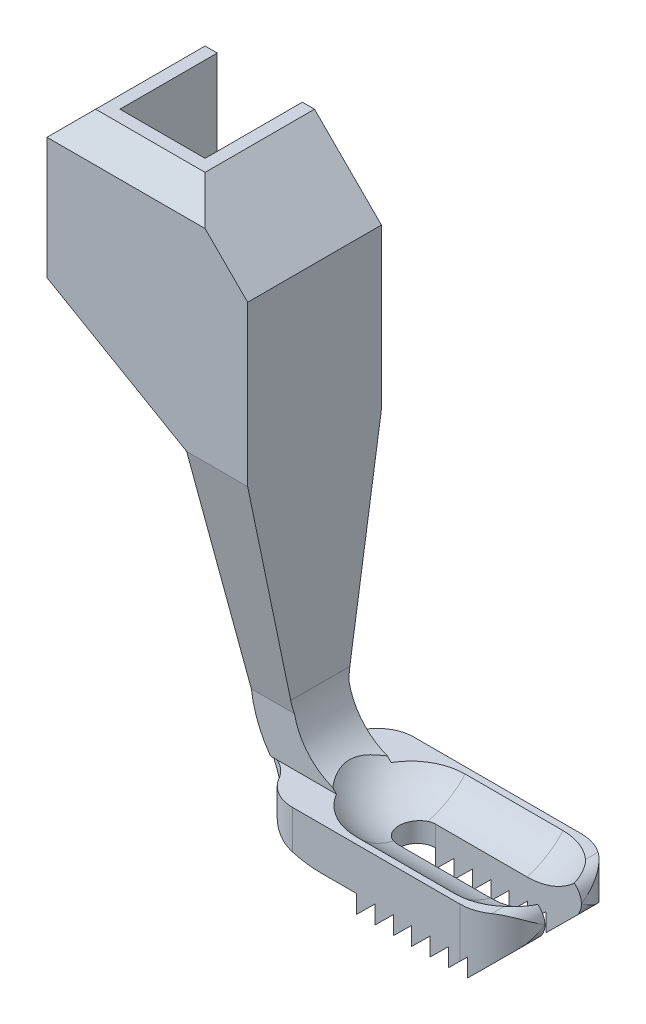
ISO-10303-21;
HEADER;
FILE_DESCRIPTION(('STEP AP214'),'2;1');
FILE_NAME('part.step','',(''),(''),'','','');
FILE_SCHEMA(('AUTOMOTIVE_DESIGN { 1 0 10303 214 1 1 1 1 }'));
ENDSEC;
DATA;
#1=APPLICATION_CONTEXT('core data for automotive mechanical design processes');
#2=APPLICATION_PROTOCOL_DEFINITION('international standard','automotive_design',2000,#1);
#3=PRODUCT_CONTEXT('',#1,'mechanical');
#4=PRODUCT('Part','Part','',(#3));
#5=PRODUCT_RELATED_PRODUCT_CATEGORY('part','',(#4));
#6=PRODUCT_DEFINITION_FORMATION('','',#4);
#7=PRODUCT_DEFINITION_CONTEXT('part definition',#1,'design');
#8=PRODUCT_DEFINITION('design','',#6,#7);
#9=PRODUCT_DEFINITION_SHAPE('','',#8);
#10=(LENGTH_UNIT() NAMED_UNIT(*) SI_UNIT(.MILLI.,.METRE.));
#11=(NAMED_UNIT(*) PLANE_ANGLE_UNIT() SI_UNIT($,.RADIAN.));
#12=(NAMED_UNIT(*) SI_UNIT($,.STERADIAN.) SOLID_ANGLE_UNIT());
#13=UNCERTAINTY_MEASURE_WITH_UNIT(LENGTH_MEASURE(1.E-05),#10,'distance_accuracy_value','');
#14=(GEOMETRIC_REPRESENTATION_CONTEXT(3) GLOBAL_UNCERTAINTY_ASSIGNED_CONTEXT((#13)) GLOBAL_UNIT_ASSIGNED_CONTEXT((#10,
#11,#12)) REPRESENTATION_CONTEXT('',''));
#15=CARTESIAN_POINT('',(0.,0.,0.));
#16=DIRECTION('',(0.,0.,1.));
#17=DIRECTION('',(1.,0.,0.));
#18=AXIS2_PLACEMENT_3D('',#15,#16,#17);
#19=CARTESIAN_POINT('',(0.,-5.,10.));
#20=DIRECTION('',(0.,-1.,0.));
#21=DIRECTION('',(0.,0.,-1.));
#22=AXIS2_PLACEMENT_3D('',#19,#20,#21);
#23=PLANE('',#22);
#24=DIRECTION('',(-1.,0.,0.));
#25=VECTOR('',#24,1.);
#26=CARTESIAN_POINT('',(2.41506753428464,-5.,9.47213595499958));
#27=LINE('',#26,#25);
#28=CARTESIAN_POINT('',(10.4707956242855,-5.,9.47213595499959));
#29=VERTEX_POINT('',#28);
#30=CARTESIAN_POINT('',(2.41506753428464,-5.,9.47213595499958));
#31=VERTEX_POINT('',#30);
#32=EDGE_CURVE('E462',#29,#31,#27,.T.);
#33=ORIENTED_EDGE('',*,*,#32,.T.);
#34=CARTESIAN_POINT('',(2.41506753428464,-5.,5.));
#35=DIRECTION('',(0.,-1.,0.));
#36=DIRECTION('',(0.,0.,-1.));
#37=AXIS2_PLACEMENT_3D('',#34,#35,#36);
#38=CIRCLE('',#37,4.47213595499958);
#39=CARTESIAN_POINT('',(-1.44983867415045,-5.,7.25));
#40=VERTEX_POINT('',#39);
#41=EDGE_CURVE('E479',#31,#40,#38,.T.);
#42=ORIENTED_EDGE('',*,*,#41,.T.);
#43=DIRECTION('',(1.,0.,0.));
#44=VECTOR('',#43,1.);
#45=CARTESIAN_POINT('',(0.,-5.,7.25));
#46=LINE('',#45,#44);
#47=CARTESIAN_POINT('',(-6.32221215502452,-5.,7.25));
#48=VERTEX_POINT('',#47);
#49=EDGE_CURVE('E644',#48,#40,#46,.T.);
#50=ORIENTED_EDGE('',*,*,#49,.F.);
#51=CARTESIAN_POINT('',(-7.5211700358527,-5.,10.));
#52=DIRECTION('',(0.,1.,0.));
#53=DIRECTION('',(0.,0.,-1.));
#54=AXIS2_PLACEMENT_3D('',#51,#52,#53);
#55=CIRCLE('',#54,3.);
#56=CARTESIAN_POINT('',(-4.92309382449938,-5.,8.5));
#57=VERTEX_POINT('',#56);
#58=EDGE_CURVE('E1133',#57,#48,#55,.T.);
#59=ORIENTED_EDGE('',*,*,#58,.F.);
#60=CARTESIAN_POINT('',(-2.32501761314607,-5.,7.));
#61=DIRECTION('',(0.,-1.,0.));
#62=DIRECTION('',(0.,0.,-1.));
#63=AXIS2_PLACEMENT_3D('',#60,#61,#62);
#64=CIRCLE('',#63,3.);
#65=CARTESIAN_POINT('',(-2.32501761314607,-5.,10.));
#66=VERTEX_POINT('',#65);
#67=EDGE_CURVE('E1131',#66,#57,#64,.T.);
#68=ORIENTED_EDGE('',*,*,#67,.F.);
#69=DIRECTION('',(-1.,0.,0.));
#70=VECTOR('',#69,1.);
#71=CARTESIAN_POINT('',(13.4429315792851,-5.,10.));
#72=LINE('',#71,#70);
#73=CARTESIAN_POINT('',(11.4429315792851,-5.,10.));
#74=VERTEX_POINT('',#73);
#75=EDGE_CURVE('E954',#74,#66,#72,.T.);
#76=ORIENTED_EDGE('',*,*,#75,.F.);
#77=CARTESIAN_POINT('',(11.4429315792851,-5.,6.5));
#78=DIRECTION('',(0.,-1.,0.));
#79=DIRECTION('',(0.,0.,-1.));
#80=AXIS2_PLACEMENT_3D('',#77,#78,#79);
#81=CIRCLE('',#80,3.5);
#82=CARTESIAN_POINT('',(13.4429315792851,-5.,9.37228132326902));
#83=VERTEX_POINT('',#82);
#84=EDGE_CURVE('E707',#83,#74,#81,.T.);
#85=ORIENTED_EDGE('',*,*,#84,.F.);
#86=DIRECTION('',(0.,0.,-1.));
#87=VECTOR('',#86,1.);
#88=CARTESIAN_POINT('',(13.4429315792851,-5.,10.));
#89=LINE('',#88,#87);
#90=CARTESIAN_POINT('',(13.4429315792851,-4.99999999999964,8.34161755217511));
#91=VERTEX_POINT('',#90);
#92=EDGE_CURVE('E999',#83,#91,#89,.T.);
#93=ORIENTED_EDGE('',*,*,#92,.T.);
#94=CARTESIAN_POINT('',(10.4707956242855,-5.,5.));
#95=DIRECTION('',(0.,-1.,0.));
#96=DIRECTION('',(0.,0.,-1.));
#97=AXIS2_PLACEMENT_3D('',#94,#95,#96);
#98=CIRCLE('',#97,4.47213595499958);
#99=EDGE_CURVE('E540',#91,#29,#98,.T.);
#100=ORIENTED_EDGE('',*,*,#99,.T.);
#101=EDGE_LOOP('',(#33,#42,#50,#59,#68,#76,#85,#93,#100));
#102=FACE_BOUND('',#101,.T.);
#103=ADVANCED_FACE('F33',(#102),#23,.F.);
#104=CARTESIAN_POINT('',(0.,0.,0.));
#105=DIRECTION('',(0.,0.,-1.));
#106=DIRECTION('',(-1.,0.,0.));
#107=AXIS2_PLACEMENT_3D('',#104,#105,#106);
#108=PLANE('',#107);
#109=DIRECTION('',(0.,1.,0.));
#110=VECTOR('',#109,1.);
#111=CARTESIAN_POINT('',(-21.5,23.6281104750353,0.));
#112=LINE('',#111,#110);
#113=CARTESIAN_POINT('',(-21.5,23.6281104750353,0.));
#114=VERTEX_POINT('',#113);
#115=CARTESIAN_POINT('',(-21.5,33.6281104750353,0.));
#116=VERTEX_POINT('',#115);
#117=EDGE_CURVE('E602',#114,#116,#112,.T.);
#118=ORIENTED_EDGE('',*,*,#117,.T.);
#119=DIRECTION('',(-0.707106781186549,-0.707106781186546,0.));
#120=VECTOR('',#119,1.);
#121=CARTESIAN_POINT('',(-27.5640552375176,27.5640552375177,0.));
#122=LINE('',#121,#120);
#123=CARTESIAN_POINT('',(-19.5,35.6281104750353,0.));
#124=VERTEX_POINT('',#123);
#125=EDGE_CURVE('E684',#116,#124,#122,.F.);
#126=ORIENTED_EDGE('',*,*,#125,.T.);
#127=DIRECTION('',(1.,0.,0.));
#128=VECTOR('',#127,1.);
#129=CARTESIAN_POINT('',(-21.5,35.6281104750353,0.));
#130=LINE('',#129,#128);
#131=CARTESIAN_POINT('',(-18.5,35.6281104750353,0.));
#132=VERTEX_POINT('',#131);
#133=EDGE_CURVE('E605',#124,#132,#130,.T.);
#134=ORIENTED_EDGE('',*,*,#133,.T.);
#135=DIRECTION('',(0.,1.,0.));
#136=VECTOR('',#135,1.);
#137=CARTESIAN_POINT('',(-18.5,0.,0.));
#138=LINE('',#137,#136);
#139=CARTESIAN_POINT('',(-18.5,21.8960596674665,0.));
#140=VERTEX_POINT('',#139);
#141=EDGE_CURVE('E669',#140,#132,#138,.T.);
#142=ORIENTED_EDGE('',*,*,#141,.F.);
#143=DIRECTION('',(-0.866025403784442,0.499999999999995,0.));
#144=VECTOR('',#143,1.);
#145=CARTESIAN_POINT('',(-10.0197758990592,17.,0.));
#146=LINE('',#145,#144);
#147=EDGE_CURVE('E596',#140,#114,#146,.T.);
#148=ORIENTED_EDGE('',*,*,#147,.T.);
#149=EDGE_LOOP('',(#118,#126,#134,#142,#148));
#150=FACE_BOUND('',#149,.T.);
#151=ADVANCED_FACE('F826',(#150),#108,.T.);
#152=DIRECTION('',(1.,0.,0.));
#153=VECTOR('',#152,1.);
#154=CARTESIAN_POINT('',(0.,-5.,2.75));
#155=LINE('',#154,#153);
#156=CARTESIAN_POINT('',(-6.32221215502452,-5.,2.75));
#157=VERTEX_POINT('',#156);
#158=CARTESIAN_POINT('',(-1.44983867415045,-5.,2.75));
#159=VERTEX_POINT('',#158);
#160=EDGE_CURVE('E476',#157,#159,#155,.T.);
#161=ORIENTED_EDGE('',*,*,#160,.T.);
#162=CARTESIAN_POINT('',(2.41506753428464,-5.,0.527864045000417));
#163=VERTEX_POINT('',#162);
#164=EDGE_CURVE('E466',#159,#163,#38,.T.);
#165=ORIENTED_EDGE('',*,*,#164,.T.);
#166=DIRECTION('',(-1.,0.,0.));
#167=VECTOR('',#166,1.);
#168=CARTESIAN_POINT('',(2.41506753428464,-5.,0.527864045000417));
#169=LINE('',#168,#167);
#170=CARTESIAN_POINT('',(10.4707956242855,-5.,0.527864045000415));
#171=VERTEX_POINT('',#170);
#172=EDGE_CURVE('E452',#163,#171,#169,.F.);
#173=ORIENTED_EDGE('',*,*,#172,.T.);
#174=CARTESIAN_POINT('',(13.4429315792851,-5.,1.65838244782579));
#175=VERTEX_POINT('',#174);
#176=EDGE_CURVE('E1273',#171,#175,#98,.T.);
#177=ORIENTED_EDGE('',*,*,#176,.T.);
#178=CARTESIAN_POINT('',(13.4429315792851,-5.,0.627718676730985));
#179=VERTEX_POINT('',#178);
#180=EDGE_CURVE('E956',#175,#179,#89,.T.);
#181=ORIENTED_EDGE('',*,*,#180,.T.);
#182=CARTESIAN_POINT('',(11.4429315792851,-5.,3.5));
#183=DIRECTION('',(0.,-1.,0.));
#184=DIRECTION('',(0.,0.,1.));
#185=AXIS2_PLACEMENT_3D('',#182,#183,#184);
#186=CIRCLE('',#185,3.5);
#187=CARTESIAN_POINT('',(11.4429315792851,-5.,0.));
#188=VERTEX_POINT('',#187);
#189=EDGE_CURVE('E781',#188,#179,#186,.T.);
#190=ORIENTED_EDGE('',*,*,#189,.F.);
#191=DIRECTION('',(-1.,0.,0.));
#192=VECTOR('',#191,1.);
#193=CARTESIAN_POINT('',(0.,-5.,0.));
#194=LINE('',#193,#192);
#195=CARTESIAN_POINT('',(-2.32501761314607,-5.,0.));
#196=VERTEX_POINT('',#195);
#197=EDGE_CURVE('E927',#188,#196,#194,.T.);
#198=ORIENTED_EDGE('',*,*,#197,.T.);
#199=CARTESIAN_POINT('',(-2.32501761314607,-5.,3.));
#200=DIRECTION('',(0.,-1.,0.));
#201=DIRECTION('',(0.,0.,1.));
#202=AXIS2_PLACEMENT_3D('',#199,#200,#201);
#203=CIRCLE('',#202,3.);
#204=CARTESIAN_POINT('',(-4.92309382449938,-5.,1.5));
#205=VERTEX_POINT('',#204);
#206=EDGE_CURVE('E1146',#205,#196,#203,.T.);
#207=ORIENTED_EDGE('',*,*,#206,.F.);
#208=CARTESIAN_POINT('',(-7.5211700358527,-5.,0.));
#209=DIRECTION('',(0.,1.,0.));
#210=DIRECTION('',(0.,0.,1.));
#211=AXIS2_PLACEMENT_3D('',#208,#209,#210);
#212=CIRCLE('',#211,3.);
#213=EDGE_CURVE('E1141',#157,#205,#212,.T.);
#214=ORIENTED_EDGE('',*,*,#213,.F.);
#215=EDGE_LOOP('',(#161,#165,#173,#177,#181,#190,#198,#207,#214));
#216=FACE_BOUND('',#215,.T.);
#217=ADVANCED_FACE('F474',(#216),#23,.F.);
#218=CARTESIAN_POINT('',(13.4429315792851,-6.5,10.));
#219=DIRECTION('',(0.,0.,-1.));
#220=DIRECTION('',(-1.,0.,0.));
#221=AXIS2_PLACEMENT_3D('',#218,#219,#220);
#222=CYLINDRICAL_SURFACE('',#221,1.5);
#223=CARTESIAN_POINT('',(13.4429315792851,-6.5,6.5));
#224=DIRECTION('',(0.,0.,1.));
#225=DIRECTION('',(1.,0.,0.));
#226=AXIS2_PLACEMENT_3D('',#223,#224,#225);
#227=CIRCLE('',#226,1.5);
#228=CARTESIAN_POINT('',(14.4979809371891,-7.56624146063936,6.5));
#229=VERTEX_POINT('',#228);
#230=CARTESIAN_POINT('',(14.9429315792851,-6.5,6.5));
#231=VERTEX_POINT('',#230);
#232=EDGE_CURVE('E876',#229,#231,#227,.T.);
#233=ORIENTED_EDGE('',*,*,#232,.T.);
#234=CARTESIAN_POINT('',(14.4979809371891,-7.56624146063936,8.20782710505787));
#235=CARTESIAN_POINT('',(14.5481686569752,-7.51652910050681,8.11801340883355));
#236=CARTESIAN_POINT('',(14.5938151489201,-7.46439816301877,8.02709795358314));
#237=CARTESIAN_POINT('',(14.676324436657,-7.35637801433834,7.84361876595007));
#238=CARTESIAN_POINT('',(14.7131935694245,-7.30049155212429,7.75105627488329));
#239=CARTESIAN_POINT('',(14.7783963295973,-7.18617864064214,7.56505564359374));
#240=CARTESIAN_POINT('',(14.8067614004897,-7.12776248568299,7.47162207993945));
#241=CARTESIAN_POINT('',(14.8553941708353,-7.00898746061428,7.28390095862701));
#242=CARTESIAN_POINT('',(14.875662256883,-6.94862868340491,7.18961344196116));
#243=CARTESIAN_POINT('',(14.9087411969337,-6.82497794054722,6.99788345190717));
#244=CARTESIAN_POINT('',(14.9213308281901,-6.7616509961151,6.90042571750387));
#245=CARTESIAN_POINT('',(14.9382783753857,-6.63437231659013,6.70526901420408));
#246=CARTESIAN_POINT('',(14.9426413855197,-6.57042099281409,6.60757023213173));
#247=CARTESIAN_POINT('',(14.942926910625,-6.50432047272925,6.50659963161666));
#248=CARTESIAN_POINT('',(14.9429315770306,-6.50216022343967,6.50329979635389));
#249=CARTESIAN_POINT('',(14.9429315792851,-6.5,6.5));
#250=B_SPLINE_CURVE_WITH_KNOTS('',3,(#234,#235,#236,#237,#238,#239,#240,#241,#242,#243,#244,
#245,#246,#247,#248,#249),.UNSPECIFIED.,.F.,.F.,(4,2,2,2,2,2,2,4),(0.,0.342565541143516,
0.684883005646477,1.0259186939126,1.36693809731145,1.71736819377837,2.06758122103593,
2.07941338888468),.UNSPECIFIED.);
#251=CARTESIAN_POINT('',(14.4979809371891,-7.56624146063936,8.20782710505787));
#252=VERTEX_POINT('',#251);
#253=EDGE_CURVE('E712',#231,#252,#250,.F.);
#254=ORIENTED_EDGE('',*,*,#253,.T.);
#255=DIRECTION('',(0.,0.,-1.));
#256=VECTOR('',#255,1.);
#257=CARTESIAN_POINT('',(14.4979809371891,-7.56624146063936,10.));
#258=LINE('',#257,#256);
#259=EDGE_CURVE('E1002',#252,#229,#258,.T.);
#260=ORIENTED_EDGE('',*,*,#259,.T.);
#261=EDGE_LOOP('',(#233,#254,#260));
#262=FACE_BOUND('',#261,.T.);
#263=ADVANCED_FACE('F734',(#262),#222,.T.);
#264=CARTESIAN_POINT('',(0.,0.,10.));
#265=DIRECTION('',(0.,0.,1.));
#266=DIRECTION('',(1.,0.,0.));
#267=AXIS2_PLACEMENT_3D('',#264,#265,#266);
#268=PLANE('',#267);
#269=DIRECTION('',(0.,1.,0.));
#270=VECTOR('',#269,1.);
#271=CARTESIAN_POINT('',(11.4429315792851,-10.,10.));
#272=LINE('',#271,#270);
#273=CARTESIAN_POINT('',(11.4429315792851,-9.08922263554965,10.));
#274=VERTEX_POINT('',#273);
#275=EDGE_CURVE('E709',#274,#74,#272,.T.);
#276=ORIENTED_EDGE('',*,*,#275,.T.);
#277=ORIENTED_EDGE('',*,*,#75,.T.);
#278=DIRECTION('',(0.,1.,0.));
#279=VECTOR('',#278,1.);
#280=CARTESIAN_POINT('',(-2.32501761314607,-10.,10.));
#281=LINE('',#280,#279);
#282=CARTESIAN_POINT('',(-2.32501761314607,-8.17583592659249,10.));
#283=VERTEX_POINT('',#282);
#284=EDGE_CURVE('E665',#66,#283,#281,.F.);
#285=ORIENTED_EDGE('',*,*,#284,.T.);
#286=CARTESIAN_POINT('',(0.,0.,10.));
#287=DIRECTION('',(0.,0.,1.));
#288=DIRECTION('',(1.,0.,0.));
#289=AXIS2_PLACEMENT_3D('',#286,#287,#288);
#290=CIRCLE('',#289,8.5);
#291=CARTESIAN_POINT('',(0.,-8.5,10.));
#292=VERTEX_POINT('',#291);
#293=EDGE_CURVE('E924',#283,#292,#290,.T.);
#294=ORIENTED_EDGE('',*,*,#293,.T.);
#295=DIRECTION('',(1.,0.,0.));
#296=VECTOR('',#295,1.);
#297=CARTESIAN_POINT('',(0.,-8.5,10.));
#298=LINE('',#297,#296);
#299=CARTESIAN_POINT('',(2.94293157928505,-8.5,10.));
#300=VERTEX_POINT('',#299);
#301=EDGE_CURVE('E926',#292,#300,#298,.T.);
#302=ORIENTED_EDGE('',*,*,#301,.T.);
#303=DIRECTION('',(0.,-1.,0.));
#304=VECTOR('',#303,1.);
#305=CARTESIAN_POINT('',(2.94293157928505,-8.5,10.));
#306=LINE('',#305,#304);
#307=CARTESIAN_POINT('',(2.94293157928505,-10.,10.));
#308=VERTEX_POINT('',#307);
#309=EDGE_CURVE('E929',#300,#308,#306,.T.);
#310=ORIENTED_EDGE('',*,*,#309,.T.);
#311=DIRECTION('',(0.71082764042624,0.703366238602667,0.));
#312=VECTOR('',#311,1.);
#313=CARTESIAN_POINT('',(2.94293157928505,-10.,10.));
#314=LINE('',#313,#312);
#315=CARTESIAN_POINT('',(4.45884377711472,-8.5,10.));
#316=VERTEX_POINT('',#315);
#317=EDGE_CURVE('E931',#308,#316,#314,.T.);
#318=ORIENTED_EDGE('',*,*,#317,.T.);
#319=DIRECTION('',(0.,-1.,0.));
#320=VECTOR('',#319,1.);
#321=CARTESIAN_POINT('',(4.45884377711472,-8.5,10.));
#322=LINE('',#321,#320);
#323=CARTESIAN_POINT('',(4.45884377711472,-10.,10.));
#324=VERTEX_POINT('',#323);
#325=EDGE_CURVE('E933',#316,#324,#322,.T.);
#326=ORIENTED_EDGE('',*,*,#325,.T.);
#327=DIRECTION('',(0.71082764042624,0.703366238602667,0.));
#328=VECTOR('',#327,1.);
#329=CARTESIAN_POINT('',(4.45884377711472,-10.,10.));
#330=LINE('',#329,#328);
#331=CARTESIAN_POINT('',(5.9747559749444,-8.5,10.));
#332=VERTEX_POINT('',#331);
#333=EDGE_CURVE('E935',#324,#332,#330,.T.);
#334=ORIENTED_EDGE('',*,*,#333,.T.);
#335=DIRECTION('',(0.,-1.,0.));
#336=VECTOR('',#335,1.);
#337=CARTESIAN_POINT('',(5.9747559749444,-8.5,10.));
#338=LINE('',#337,#336);
#339=CARTESIAN_POINT('',(5.9747559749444,-10.,10.));
#340=VERTEX_POINT('',#339);
#341=EDGE_CURVE('E937',#332,#340,#338,.T.);
#342=ORIENTED_EDGE('',*,*,#341,.T.);
#343=DIRECTION('',(0.71082764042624,0.703366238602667,0.));
#344=VECTOR('',#343,1.);
#345=CARTESIAN_POINT('',(5.9747559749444,-10.,10.));
#346=LINE('',#345,#344);
#347=CARTESIAN_POINT('',(7.49066817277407,-8.5,10.));
#348=VERTEX_POINT('',#347);
#349=EDGE_CURVE('E939',#340,#348,#346,.T.);
#350=ORIENTED_EDGE('',*,*,#349,.T.);
#351=DIRECTION('',(0.,-1.,0.));
#352=VECTOR('',#351,1.);
#353=CARTESIAN_POINT('',(7.49066817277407,-8.5,10.));
#354=LINE('',#353,#352);
#355=CARTESIAN_POINT('',(7.49066817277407,-10.,10.));
#356=VERTEX_POINT('',#355);
#357=EDGE_CURVE('E941',#348,#356,#354,.T.);
#358=ORIENTED_EDGE('',*,*,#357,.T.);
#359=DIRECTION('',(0.71082764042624,0.703366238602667,0.));
#360=VECTOR('',#359,1.);
#361=CARTESIAN_POINT('',(7.49066817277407,-10.,10.));
#362=LINE('',#361,#360);
#363=CARTESIAN_POINT('',(9.00658037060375,-8.5,10.));
#364=VERTEX_POINT('',#363);
#365=EDGE_CURVE('E943',#356,#364,#362,.T.);
#366=ORIENTED_EDGE('',*,*,#365,.T.);
#367=DIRECTION('',(0.,-1.,0.));
#368=VECTOR('',#367,1.);
#369=CARTESIAN_POINT('',(9.00658037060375,-8.5,10.));
#370=LINE('',#369,#368);
#371=CARTESIAN_POINT('',(9.00658037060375,-10.,10.));
#372=VERTEX_POINT('',#371);
#373=EDGE_CURVE('E945',#364,#372,#370,.T.);
#374=ORIENTED_EDGE('',*,*,#373,.T.);
#375=DIRECTION('',(0.71082764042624,0.703366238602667,0.));
#376=VECTOR('',#375,1.);
#377=CARTESIAN_POINT('',(9.00658037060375,-10.,10.));
#378=LINE('',#377,#376);
#379=CARTESIAN_POINT('',(10.5224925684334,-8.5,10.));
#380=VERTEX_POINT('',#379);
#381=EDGE_CURVE('E947',#372,#380,#378,.T.);
#382=ORIENTED_EDGE('',*,*,#381,.T.);
#383=DIRECTION('',(0.,-1.,0.));
#384=VECTOR('',#383,1.);
#385=CARTESIAN_POINT('',(10.5224925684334,-8.5,10.));
#386=LINE('',#385,#384);
#387=CARTESIAN_POINT('',(10.5224925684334,-10.,10.));
#388=VERTEX_POINT('',#387);
#389=EDGE_CURVE('E949',#380,#388,#386,.T.);
#390=ORIENTED_EDGE('',*,*,#389,.T.);
#391=DIRECTION('',(0.71082764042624,0.703366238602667,0.));
#392=VECTOR('',#391,1.);
#393=CARTESIAN_POINT('',(10.5224925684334,-10.,10.));
#394=LINE('',#393,#392);
#395=EDGE_CURVE('E951',#388,#274,#394,.T.);
#396=ORIENTED_EDGE('',*,*,#395,.T.);
#397=EDGE_LOOP('',(#276,#277,#285,#294,#302,#310,#318,#326,#334,#342,#350,#358,#366,#374,#382,
#390,#396));
#398=FACE_BOUND('',#397,.T.);
#399=ADVANCED_FACE('F837',(#398),#268,.T.);
#400=CARTESIAN_POINT('',(0.,0.,0.));
#401=DIRECTION('',(0.,0.,1.));
#402=DIRECTION('',(1.,0.,0.));
#403=AXIS2_PLACEMENT_3D('',#400,#401,#402);
#404=PLANE('',#403);
#405=DIRECTION('',(0.,1.,0.));
#406=VECTOR('',#405,1.);
#407=CARTESIAN_POINT('',(-2.32501761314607,-10.,0.));
#408=LINE('',#407,#406);
#409=CARTESIAN_POINT('',(-2.32501761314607,-8.17583592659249,0.));
#410=VERTEX_POINT('',#409);
#411=EDGE_CURVE('E1060',#196,#410,#408,.F.);
#412=ORIENTED_EDGE('',*,*,#411,.F.);
#413=ORIENTED_EDGE('',*,*,#197,.F.);
#414=DIRECTION('',(0.,1.,0.));
#415=VECTOR('',#414,1.);
#416=CARTESIAN_POINT('',(11.4429315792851,-10.,0.));
#417=LINE('',#416,#415);
#418=CARTESIAN_POINT('',(11.4429315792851,-9.08922263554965,0.));
#419=VERTEX_POINT('',#418);
#420=EDGE_CURVE('E1283',#419,#188,#417,.T.);
#421=ORIENTED_EDGE('',*,*,#420,.F.);
#422=DIRECTION('',(0.71082764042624,0.703366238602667,0.));
#423=VECTOR('',#422,1.);
#424=CARTESIAN_POINT('',(10.5224925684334,-10.,0.));
#425=LINE('',#424,#423);
#426=CARTESIAN_POINT('',(10.5224925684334,-10.,0.));
#427=VERTEX_POINT('',#426);
#428=EDGE_CURVE('E994',#427,#419,#425,.T.);
#429=ORIENTED_EDGE('',*,*,#428,.F.);
#430=DIRECTION('',(0.,-1.,0.));
#431=VECTOR('',#430,1.);
#432=CARTESIAN_POINT('',(10.5224925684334,-8.5,0.));
#433=LINE('',#432,#431);
#434=CARTESIAN_POINT('',(10.5224925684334,-8.5,0.));
#435=VERTEX_POINT('',#434);
#436=EDGE_CURVE('E991',#435,#427,#433,.T.);
#437=ORIENTED_EDGE('',*,*,#436,.F.);
#438=DIRECTION('',(0.71082764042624,0.703366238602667,0.));
#439=VECTOR('',#438,1.);
#440=CARTESIAN_POINT('',(9.00658037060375,-10.,0.));
#441=LINE('',#440,#439);
#442=CARTESIAN_POINT('',(9.00658037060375,-10.,0.));
#443=VERTEX_POINT('',#442);
#444=EDGE_CURVE('E988',#443,#435,#441,.T.);
#445=ORIENTED_EDGE('',*,*,#444,.F.);
#446=DIRECTION('',(0.,-1.,0.));
#447=VECTOR('',#446,1.);
#448=CARTESIAN_POINT('',(9.00658037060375,-8.5,0.));
#449=LINE('',#448,#447);
#450=CARTESIAN_POINT('',(9.00658037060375,-8.5,0.));
#451=VERTEX_POINT('',#450);
#452=EDGE_CURVE('E985',#451,#443,#449,.T.);
#453=ORIENTED_EDGE('',*,*,#452,.F.);
#454=DIRECTION('',(0.71082764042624,0.703366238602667,0.));
#455=VECTOR('',#454,1.);
#456=CARTESIAN_POINT('',(7.49066817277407,-10.,0.));
#457=LINE('',#456,#455);
#458=CARTESIAN_POINT('',(7.49066817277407,-10.,0.));
#459=VERTEX_POINT('',#458);
#460=EDGE_CURVE('E982',#459,#451,#457,.T.);
#461=ORIENTED_EDGE('',*,*,#460,.F.);
#462=DIRECTION('',(0.,-1.,0.));
#463=VECTOR('',#462,1.);
#464=CARTESIAN_POINT('',(7.49066817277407,-8.5,0.));
#465=LINE('',#464,#463);
#466=CARTESIAN_POINT('',(7.49066817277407,-8.5,0.));
#467=VERTEX_POINT('',#466);
#468=EDGE_CURVE('E979',#467,#459,#465,.T.);
#469=ORIENTED_EDGE('',*,*,#468,.F.);
#470=DIRECTION('',(0.71082764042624,0.703366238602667,0.));
#471=VECTOR('',#470,1.);
#472=CARTESIAN_POINT('',(5.9747559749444,-10.,0.));
#473=LINE('',#472,#471);
#474=CARTESIAN_POINT('',(5.9747559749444,-10.,0.));
#475=VERTEX_POINT('',#474);
#476=EDGE_CURVE('E976',#475,#467,#473,.T.);
#477=ORIENTED_EDGE('',*,*,#476,.F.);
#478=DIRECTION('',(0.,-1.,0.));
#479=VECTOR('',#478,1.);
#480=CARTESIAN_POINT('',(5.9747559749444,-8.5,0.));
#481=LINE('',#480,#479);
#482=CARTESIAN_POINT('',(5.9747559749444,-8.5,0.));
#483=VERTEX_POINT('',#482);
#484=EDGE_CURVE('E973',#483,#475,#481,.T.);
#485=ORIENTED_EDGE('',*,*,#484,.F.);
#486=DIRECTION('',(0.71082764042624,0.703366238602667,0.));
#487=VECTOR('',#486,1.);
#488=CARTESIAN_POINT('',(4.45884377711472,-10.,0.));
#489=LINE('',#488,#487);
#490=CARTESIAN_POINT('',(4.45884377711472,-10.,0.));
#491=VERTEX_POINT('',#490);
#492=EDGE_CURVE('E970',#491,#483,#489,.T.);
#493=ORIENTED_EDGE('',*,*,#492,.F.);
#494=DIRECTION('',(0.,-1.,0.));
#495=VECTOR('',#494,1.);
#496=CARTESIAN_POINT('',(4.45884377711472,-8.5,0.));
#497=LINE('',#496,#495);
#498=CARTESIAN_POINT('',(4.45884377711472,-8.5,0.));
#499=VERTEX_POINT('',#498);
#500=EDGE_CURVE('E967',#499,#491,#497,.T.);
#501=ORIENTED_EDGE('',*,*,#500,.F.);
#502=DIRECTION('',(0.71082764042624,0.703366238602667,0.));
#503=VECTOR('',#502,1.);
#504=CARTESIAN_POINT('',(2.94293157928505,-10.,0.));
#505=LINE('',#504,#503);
#506=CARTESIAN_POINT('',(2.94293157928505,-10.,0.));
#507=VERTEX_POINT('',#506);
#508=EDGE_CURVE('E964',#507,#499,#505,.T.);
#509=ORIENTED_EDGE('',*,*,#508,.F.);
#510=DIRECTION('',(0.,-1.,0.));
#511=VECTOR('',#510,1.);
#512=CARTESIAN_POINT('',(2.94293157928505,-8.5,0.));
#513=LINE('',#512,#511);
#514=CARTESIAN_POINT('',(2.94293157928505,-8.5,0.));
#515=VERTEX_POINT('',#514);
#516=EDGE_CURVE('E961',#515,#507,#513,.T.);
#517=ORIENTED_EDGE('',*,*,#516,.F.);
#518=DIRECTION('',(1.,0.,0.));
#519=VECTOR('',#518,1.);
#520=CARTESIAN_POINT('',(0.,-8.5,0.));
#521=LINE('',#520,#519);
#522=CARTESIAN_POINT('',(0.,-8.5,0.));
#523=VERTEX_POINT('',#522);
#524=EDGE_CURVE('E958',#523,#515,#521,.T.);
#525=ORIENTED_EDGE('',*,*,#524,.F.);
#526=CARTESIAN_POINT('',(0.,0.,0.));
#527=DIRECTION('',(0.,0.,1.));
#528=DIRECTION('',(1.,0.,0.));
#529=AXIS2_PLACEMENT_3D('',#526,#527,#528);
#530=CIRCLE('',#529,8.5);
#531=EDGE_CURVE('E923',#410,#523,#530,.T.);
#532=ORIENTED_EDGE('',*,*,#531,.F.);
#533=EDGE_LOOP('',(#412,#413,#421,#429,#437,#445,#453,#461,#469,#477,#485,#493,#501,#509,#517,
#525,#532));
#534=FACE_BOUND('',#533,.T.);
#535=ADVANCED_FACE('F843',(#534),#404,.F.);
#536=CARTESIAN_POINT('',(14.4979809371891,-7.56624146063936,3.5));
#537=VERTEX_POINT('',#536);
#538=CARTESIAN_POINT('',(14.4979809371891,-7.56624146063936,1.79217289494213));
#539=VERTEX_POINT('',#538);
#540=EDGE_CURVE('E1001',#537,#539,#258,.T.);
#541=ORIENTED_EDGE('',*,*,#540,.T.);
#542=CARTESIAN_POINT('',(14.4979809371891,-7.56624146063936,1.79217289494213));
#543=CARTESIAN_POINT('',(14.5481686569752,-7.5165291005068,1.88198659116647));
#544=CARTESIAN_POINT('',(14.5938151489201,-7.46439816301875,1.97290204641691));
#545=CARTESIAN_POINT('',(14.6763244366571,-7.35637801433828,2.15638123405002));
#546=CARTESIAN_POINT('',(14.7131935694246,-7.30049155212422,2.24894372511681));
#547=CARTESIAN_POINT('',(14.7783963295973,-7.18617864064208,2.43494435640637));
#548=CARTESIAN_POINT('',(14.8067614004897,-7.12776248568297,2.52837792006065));
#549=CARTESIAN_POINT('',(14.8553941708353,-7.00898746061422,2.71609904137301));
#550=CARTESIAN_POINT('',(14.8756622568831,-6.94862868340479,2.81038655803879));
#551=CARTESIAN_POINT('',(14.9087411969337,-6.82497794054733,3.0021165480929));
#552=CARTESIAN_POINT('',(14.9213308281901,-6.76165099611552,3.0995742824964));
#553=CARTESIAN_POINT('',(14.9382783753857,-6.6343723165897,3.29473098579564));
#554=CARTESIAN_POINT('',(14.9426413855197,-6.57042099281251,3.39242976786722));
#555=CARTESIAN_POINT('',(14.942926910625,-6.50432047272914,3.49340036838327));
#556=CARTESIAN_POINT('',(14.9429315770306,-6.50216022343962,3.49670020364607));
#557=CARTESIAN_POINT('',(14.9429315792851,-6.5,3.5));
#558=B_SPLINE_CURVE_WITH_KNOTS('',3,(#542,#543,#544,#545,#546,#547,#548,#549,#550,#551,#552,
#553,#554,#555,#556,#557),.UNSPECIFIED.,.F.,.F.,(4,2,2,2,2,2,2,4),(0.,0.342565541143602,
0.684883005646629,1.02591869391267,1.36693809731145,1.71736819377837,2.06758122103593,
2.07941338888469),.UNSPECIFIED.);
#559=CARTESIAN_POINT('',(14.9429315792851,-6.5,3.5));
#560=VERTEX_POINT('',#559);
#561=EDGE_CURVE('E749',#539,#560,#558,.T.);
#562=ORIENTED_EDGE('',*,*,#561,.T.);
#563=CARTESIAN_POINT('',(13.4429315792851,-6.5,3.5));
#564=DIRECTION('',(0.,0.,-1.));
#565=DIRECTION('',(-1.,0.,0.));
#566=AXIS2_PLACEMENT_3D('',#563,#564,#565);
#567=CIRCLE('',#566,1.5);
#568=EDGE_CURVE('E1176',#560,#537,#567,.T.);
#569=ORIENTED_EDGE('',*,*,#568,.T.);
#570=EDGE_LOOP('',(#541,#562,#569));
#571=FACE_BOUND('',#570,.T.);
#572=ADVANCED_FACE('F839',(#571),#222,.T.);
#573=CARTESIAN_POINT('',(2.94293157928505,-8.5,10.));
#574=DIRECTION('',(1.,0.,0.));
#575=DIRECTION('',(0.,0.,-1.));
#576=AXIS2_PLACEMENT_3D('',#573,#574,#575);
#577=PLANE('',#576);
#578=DIRECTION('',(0.,0.,-1.));
#579=VECTOR('',#578,1.);
#580=CARTESIAN_POINT('',(2.94293157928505,-8.5,10.));
#581=LINE('',#580,#579);
#582=CARTESIAN_POINT('',(2.94293157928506,-8.5,6.5));
#583=VERTEX_POINT('',#582);
#584=EDGE_CURVE('E1055',#300,#583,#581,.T.);
#585=ORIENTED_EDGE('',*,*,#584,.T.);
#586=DIRECTION('',(0.,1.,0.));
#587=VECTOR('',#586,1.);
#588=CARTESIAN_POINT('',(2.94293157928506,-10.,6.5));
#589=LINE('',#588,#587);
#590=CARTESIAN_POINT('',(2.94293157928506,-10.,6.5));
#591=VERTEX_POINT('',#590);
#592=EDGE_CURVE('E1084',#591,#583,#589,.T.);
#593=ORIENTED_EDGE('',*,*,#592,.F.);
#594=DIRECTION('',(0.,0.,-1.));
#595=VECTOR('',#594,1.);
#596=CARTESIAN_POINT('',(2.94293157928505,-10.,10.));
#597=LINE('',#596,#595);
#598=EDGE_CURVE('E1051',#308,#591,#597,.T.);
#599=ORIENTED_EDGE('',*,*,#598,.F.);
#600=ORIENTED_EDGE('',*,*,#309,.F.);
#601=EDGE_LOOP('',(#585,#593,#599,#600));
#602=FACE_BOUND('',#601,.T.);
#603=ADVANCED_FACE('F847',(#602),#577,.F.);
#604=CARTESIAN_POINT('',(2.94293157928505,-10.,10.));
#605=DIRECTION('',(-0.703366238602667,0.71082764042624,0.));
#606=DIRECTION('',(-0.71082764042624,-0.703366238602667,0.));
#607=AXIS2_PLACEMENT_3D('',#604,#605,#606);
#608=PLANE('',#607);
#609=ORIENTED_EDGE('',*,*,#598,.T.);
#610=DIRECTION('',(0.71082764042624,0.703366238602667,0.));
#611=VECTOR('',#610,1.);
#612=CARTESIAN_POINT('',(2.94293157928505,-10.,6.5));
#613=LINE('',#612,#611);
#614=CARTESIAN_POINT('',(4.45884377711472,-8.5,6.5));
#615=VERTEX_POINT('',#614);
#616=EDGE_CURVE('E920',#591,#615,#613,.T.);
#617=ORIENTED_EDGE('',*,*,#616,.T.);
#618=DIRECTION('',(0.,0.,-1.));
#619=VECTOR('',#618,1.);
#620=CARTESIAN_POINT('',(4.45884377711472,-8.5,10.));
#621=LINE('',#620,#619);
#622=EDGE_CURVE('E1047',#316,#615,#621,.T.);
#623=ORIENTED_EDGE('',*,*,#622,.F.);
#624=ORIENTED_EDGE('',*,*,#317,.F.);
#625=EDGE_LOOP('',(#609,#617,#623,#624));
#626=FACE_BOUND('',#625,.T.);
#627=ADVANCED_FACE('F853',(#626),#608,.F.);
#628=CARTESIAN_POINT('',(4.45884377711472,-8.5,10.));
#629=DIRECTION('',(1.,0.,0.));
#630=DIRECTION('',(0.,0.,-1.));
#631=AXIS2_PLACEMENT_3D('',#628,#629,#630);
#632=PLANE('',#631);
#633=ORIENTED_EDGE('',*,*,#622,.T.);
#634=DIRECTION('',(0.,-1.,0.));
#635=VECTOR('',#634,1.);
#636=CARTESIAN_POINT('',(4.45884377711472,-8.5,6.5));
#637=LINE('',#636,#635);
#638=CARTESIAN_POINT('',(4.45884377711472,-10.,6.5));
#639=VERTEX_POINT('',#638);
#640=EDGE_CURVE('E917',#615,#639,#637,.T.);
#641=ORIENTED_EDGE('',*,*,#640,.T.);
#642=DIRECTION('',(0.,0.,-1.));
#643=VECTOR('',#642,1.);
#644=CARTESIAN_POINT('',(4.45884377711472,-10.,10.));
#645=LINE('',#644,#643);
#646=EDGE_CURVE('E1043',#324,#639,#645,.T.);
#647=ORIENTED_EDGE('',*,*,#646,.F.);
#648=ORIENTED_EDGE('',*,*,#325,.F.);
#649=EDGE_LOOP('',(#633,#641,#647,#648));
#650=FACE_BOUND('',#649,.T.);
#651=ADVANCED_FACE('F1089',(#650),#632,.F.);
#652=CARTESIAN_POINT('',(4.45884377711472,-10.,10.));
#653=DIRECTION('',(-0.703366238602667,0.71082764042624,0.));
#654=DIRECTION('',(-0.71082764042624,-0.703366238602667,0.));
#655=AXIS2_PLACEMENT_3D('',#652,#653,#654);
#656=PLANE('',#655);
#657=ORIENTED_EDGE('',*,*,#646,.T.);
#658=DIRECTION('',(0.71082764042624,0.703366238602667,0.));
#659=VECTOR('',#658,1.);
#660=CARTESIAN_POINT('',(4.45884377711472,-10.,6.5));
#661=LINE('',#660,#659);
#662=CARTESIAN_POINT('',(5.9747559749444,-8.5,6.5));
#663=VERTEX_POINT('',#662);
#664=EDGE_CURVE('E914',#639,#663,#661,.T.);
#665=ORIENTED_EDGE('',*,*,#664,.T.);
#666=DIRECTION('',(0.,0.,-1.));
#667=VECTOR('',#666,1.);
#668=CARTESIAN_POINT('',(5.9747559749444,-8.5,10.));
#669=LINE('',#668,#667);
#670=EDGE_CURVE('E1039',#332,#663,#669,.T.);
#671=ORIENTED_EDGE('',*,*,#670,.F.);
#672=ORIENTED_EDGE('',*,*,#333,.F.);
#673=EDGE_LOOP('',(#657,#665,#671,#672));
#674=FACE_BOUND('',#673,.T.);
#675=ADVANCED_FACE('F1095',(#674),#656,.F.);
#676=CARTESIAN_POINT('',(5.9747559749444,-8.5,10.));
#677=DIRECTION('',(1.,0.,0.));
#678=DIRECTION('',(0.,0.,-1.));
#679=AXIS2_PLACEMENT_3D('',#676,#677,#678);
#680=PLANE('',#679);
#681=ORIENTED_EDGE('',*,*,#670,.T.);
#682=DIRECTION('',(0.,-1.,0.));
#683=VECTOR('',#682,1.);
#684=CARTESIAN_POINT('',(5.9747559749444,-8.5,6.5));
#685=LINE('',#684,#683);
#686=CARTESIAN_POINT('',(5.9747559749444,-10.,6.5));
#687=VERTEX_POINT('',#686);
#688=EDGE_CURVE('E911',#663,#687,#685,.T.);
#689=ORIENTED_EDGE('',*,*,#688,.T.);
#690=DIRECTION('',(0.,0.,-1.));
#691=VECTOR('',#690,1.);
#692=CARTESIAN_POINT('',(5.9747559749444,-10.,10.));
#693=LINE('',#692,#691);
#694=EDGE_CURVE('E1035',#340,#687,#693,.T.);
#695=ORIENTED_EDGE('',*,*,#694,.F.);
#696=ORIENTED_EDGE('',*,*,#341,.F.);
#697=EDGE_LOOP('',(#681,#689,#695,#696));
#698=FACE_BOUND('',#697,.T.);
#699=ADVANCED_FACE('F1097',(#698),#680,.F.);
#700=CARTESIAN_POINT('',(5.9747559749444,-10.,10.));
#701=DIRECTION('',(-0.703366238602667,0.71082764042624,0.));
#702=DIRECTION('',(-0.71082764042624,-0.703366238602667,0.));
#703=AXIS2_PLACEMENT_3D('',#700,#701,#702);
#704=PLANE('',#703);
#705=ORIENTED_EDGE('',*,*,#694,.T.);
#706=DIRECTION('',(0.71082764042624,0.703366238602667,0.));
#707=VECTOR('',#706,1.);
#708=CARTESIAN_POINT('',(5.9747559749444,-10.,6.5));
#709=LINE('',#708,#707);
#710=CARTESIAN_POINT('',(7.49066817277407,-8.5,6.5));
#711=VERTEX_POINT('',#710);
#712=EDGE_CURVE('E908',#687,#711,#709,.T.);
#713=ORIENTED_EDGE('',*,*,#712,.T.);
#714=DIRECTION('',(0.,0.,-1.));
#715=VECTOR('',#714,1.);
#716=CARTESIAN_POINT('',(7.49066817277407,-8.5,10.));
#717=LINE('',#716,#715);
#718=EDGE_CURVE('E1031',#348,#711,#717,.T.);
#719=ORIENTED_EDGE('',*,*,#718,.F.);
#720=ORIENTED_EDGE('',*,*,#349,.F.);
#721=EDGE_LOOP('',(#705,#713,#719,#720));
#722=FACE_BOUND('',#721,.T.);
#723=ADVANCED_FACE('F1101',(#722),#704,.F.);
#724=CARTESIAN_POINT('',(7.49066817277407,-8.5,10.));
#725=DIRECTION('',(1.,0.,0.));
#726=DIRECTION('',(0.,0.,-1.));
#727=AXIS2_PLACEMENT_3D('',#724,#725,#726);
#728=PLANE('',#727);
#729=ORIENTED_EDGE('',*,*,#718,.T.);
#730=DIRECTION('',(0.,-1.,0.));
#731=VECTOR('',#730,1.);
#732=CARTESIAN_POINT('',(7.49066817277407,-8.5,6.5));
#733=LINE('',#732,#731);
#734=CARTESIAN_POINT('',(7.49066817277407,-10.,6.5));
#735=VERTEX_POINT('',#734);
#736=EDGE_CURVE('E905',#711,#735,#733,.T.);
#737=ORIENTED_EDGE('',*,*,#736,.T.);
#738=DIRECTION('',(0.,0.,-1.));
#739=VECTOR('',#738,1.);
#740=CARTESIAN_POINT('',(7.49066817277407,-10.,10.));
#741=LINE('',#740,#739);
#742=EDGE_CURVE('E1027',#356,#735,#741,.T.);
#743=ORIENTED_EDGE('',*,*,#742,.F.);
#744=ORIENTED_EDGE('',*,*,#357,.F.);
#745=EDGE_LOOP('',(#729,#737,#743,#744));
#746=FACE_BOUND('',#745,.T.);
#747=ADVANCED_FACE('F1107',(#746),#728,.F.);
#748=CARTESIAN_POINT('',(7.49066817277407,-10.,10.));
#749=DIRECTION('',(-0.703366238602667,0.71082764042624,0.));
#750=DIRECTION('',(-0.71082764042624,-0.703366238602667,0.));
#751=AXIS2_PLACEMENT_3D('',#748,#749,#750);
#752=PLANE('',#751);
#753=ORIENTED_EDGE('',*,*,#742,.T.);
#754=DIRECTION('',(0.71082764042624,0.703366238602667,0.));
#755=VECTOR('',#754,1.);
#756=CARTESIAN_POINT('',(7.49066817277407,-10.,6.5));
#757=LINE('',#756,#755);
#758=CARTESIAN_POINT('',(9.00658037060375,-8.5,6.5));
#759=VERTEX_POINT('',#758);
#760=EDGE_CURVE('E902',#735,#759,#757,.T.);
#761=ORIENTED_EDGE('',*,*,#760,.T.);
#762=DIRECTION('',(0.,0.,-1.));
#763=VECTOR('',#762,1.);
#764=CARTESIAN_POINT('',(9.00658037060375,-8.5,10.));
#765=LINE('',#764,#763);
#766=EDGE_CURVE('E1023',#364,#759,#765,.T.);
#767=ORIENTED_EDGE('',*,*,#766,.F.);
#768=ORIENTED_EDGE('',*,*,#365,.F.);
#769=EDGE_LOOP('',(#753,#761,#767,#768));
#770=FACE_BOUND('',#769,.T.);
#771=ADVANCED_FACE('F1109',(#770),#752,.F.);
#772=CARTESIAN_POINT('',(9.00658037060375,-8.5,10.));
#773=DIRECTION('',(1.,0.,0.));
#774=DIRECTION('',(0.,0.,-1.));
#775=AXIS2_PLACEMENT_3D('',#772,#773,#774);
#776=PLANE('',#775);
#777=ORIENTED_EDGE('',*,*,#766,.T.);
#778=DIRECTION('',(0.,-1.,0.));
#779=VECTOR('',#778,1.);
#780=CARTESIAN_POINT('',(9.00658037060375,-8.5,6.5));
#781=LINE('',#780,#779);
#782=CARTESIAN_POINT('',(9.00658037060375,-10.,6.5));
#783=VERTEX_POINT('',#782);
#784=EDGE_CURVE('E899',#759,#783,#781,.T.);
#785=ORIENTED_EDGE('',*,*,#784,.T.);
#786=DIRECTION('',(0.,0.,-1.));
#787=VECTOR('',#786,1.);
#788=CARTESIAN_POINT('',(9.00658037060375,-10.,10.));
#789=LINE('',#788,#787);
#790=EDGE_CURVE('E1019',#372,#783,#789,.T.);
#791=ORIENTED_EDGE('',*,*,#790,.F.);
#792=ORIENTED_EDGE('',*,*,#373,.F.);
#793=EDGE_LOOP('',(#777,#785,#791,#792));
#794=FACE_BOUND('',#793,.T.);
#795=ADVANCED_FACE('F1113',(#794),#776,.F.);
#796=CARTESIAN_POINT('',(9.00658037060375,-10.,10.));
#797=DIRECTION('',(-0.703366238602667,0.71082764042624,0.));
#798=DIRECTION('',(-0.71082764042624,-0.703366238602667,0.));
#799=AXIS2_PLACEMENT_3D('',#796,#797,#798);
#800=PLANE('',#799);
#801=ORIENTED_EDGE('',*,*,#790,.T.);
#802=DIRECTION('',(0.71082764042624,0.703366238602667,0.));
#803=VECTOR('',#802,1.);
#804=CARTESIAN_POINT('',(9.00658037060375,-10.,6.5));
#805=LINE('',#804,#803);
#806=CARTESIAN_POINT('',(10.5224925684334,-8.5,6.5));
#807=VERTEX_POINT('',#806);
#808=EDGE_CURVE('E896',#783,#807,#805,.T.);
#809=ORIENTED_EDGE('',*,*,#808,.T.);
#810=DIRECTION('',(0.,0.,-1.));
#811=VECTOR('',#810,1.);
#812=CARTESIAN_POINT('',(10.5224925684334,-8.5,10.));
#813=LINE('',#812,#811);
#814=EDGE_CURVE('E1015',#380,#807,#813,.T.);
#815=ORIENTED_EDGE('',*,*,#814,.F.);
#816=ORIENTED_EDGE('',*,*,#381,.F.);
#817=EDGE_LOOP('',(#801,#809,#815,#816));
#818=FACE_BOUND('',#817,.T.);
#819=ADVANCED_FACE('F1119',(#818),#800,.F.);
#820=CARTESIAN_POINT('',(10.5224925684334,-8.5,10.));
#821=DIRECTION('',(1.,0.,0.));
#822=DIRECTION('',(0.,1.,0.));
#823=AXIS2_PLACEMENT_3D('',#820,#821,#822);
#824=PLANE('',#823);
#825=ORIENTED_EDGE('',*,*,#814,.T.);
#826=DIRECTION('',(0.,-1.,0.));
#827=VECTOR('',#826,1.);
#828=CARTESIAN_POINT('',(10.5224925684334,-8.5,6.5));
#829=LINE('',#828,#827);
#830=CARTESIAN_POINT('',(10.5224925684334,-10.,6.5));
#831=VERTEX_POINT('',#830);
#832=EDGE_CURVE('E893',#807,#831,#829,.T.);
#833=ORIENTED_EDGE('',*,*,#832,.T.);
#834=DIRECTION('',(0.,0.,-1.));
#835=VECTOR('',#834,1.);
#836=CARTESIAN_POINT('',(10.5224925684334,-10.,10.));
#837=LINE('',#836,#835);
#838=EDGE_CURVE('E1011',#388,#831,#837,.T.);
#839=ORIENTED_EDGE('',*,*,#838,.F.);
#840=ORIENTED_EDGE('',*,*,#389,.F.);
#841=EDGE_LOOP('',(#825,#833,#839,#840));
#842=FACE_BOUND('',#841,.T.);
#843=ADVANCED_FACE('F1121',(#842),#824,.F.);
#844=CARTESIAN_POINT('',(10.5224925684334,-10.,10.));
#845=DIRECTION('',(-0.703366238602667,0.71082764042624,0.));
#846=DIRECTION('',(-0.71082764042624,-0.703366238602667,0.));
#847=AXIS2_PLACEMENT_3D('',#844,#845,#846);
#848=PLANE('',#847);
#849=DIRECTION('',(0.,0.,-1.));
#850=VECTOR('',#849,1.);
#851=CARTESIAN_POINT('',(12.0384047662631,-8.5,10.));
#852=LINE('',#851,#850);
#853=CARTESIAN_POINT('',(12.0384047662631,-8.5,9.94897255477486));
#854=VERTEX_POINT('',#853);
#855=CARTESIAN_POINT('',(12.0384047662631,-8.5,6.5));
#856=VERTEX_POINT('',#855);
#857=EDGE_CURVE('E1008',#854,#856,#852,.T.);
#858=ORIENTED_EDGE('',*,*,#857,.F.);
#859=CARTESIAN_POINT('',(11.4429315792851,-9.08922263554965,6.5));
#860=DIRECTION('',(-0.703366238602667,0.71082764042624,0.));
#861=DIRECTION('',(0.71082764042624,0.703366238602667,0.));
#862=AXIS2_PLACEMENT_3D('',#859,#860,#861);
#863=ELLIPSE('',#862,4.92383779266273,3.5);
#864=EDGE_CURVE('E1127',#854,#274,#863,.F.);
#865=ORIENTED_EDGE('',*,*,#864,.T.);
#866=ORIENTED_EDGE('',*,*,#395,.F.);
#867=ORIENTED_EDGE('',*,*,#838,.T.);
#868=DIRECTION('',(0.71082764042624,0.703366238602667,0.));
#869=VECTOR('',#868,1.);
#870=CARTESIAN_POINT('',(10.5224925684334,-10.,6.5));
#871=LINE('',#870,#869);
#872=EDGE_CURVE('E890',#831,#856,#871,.T.);
#873=ORIENTED_EDGE('',*,*,#872,.T.);
#874=EDGE_LOOP('',(#858,#865,#866,#867,#873));
#875=FACE_BOUND('',#874,.T.);
#876=ADVANCED_FACE('F1126',(#875),#848,.F.);
#877=CARTESIAN_POINT('',(12.0384047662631,-8.5,10.));
#878=DIRECTION('',(1.,0.,0.));
#879=DIRECTION('',(0.,1.,0.));
#880=AXIS2_PLACEMENT_3D('',#877,#878,#879);
#881=PLANE('',#880);
#882=DIRECTION('',(0.,0.,-1.));
#883=VECTOR('',#882,1.);
#884=CARTESIAN_POINT('',(12.0384047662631,-10.,10.));
#885=LINE('',#884,#883);
#886=CARTESIAN_POINT('',(12.0384047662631,-10.,9.94897255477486));
#887=VERTEX_POINT('',#886);
#888=CARTESIAN_POINT('',(12.0384047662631,-10.,6.5));
#889=VERTEX_POINT('',#888);
#890=EDGE_CURVE('E1005',#887,#889,#885,.T.);
#891=ORIENTED_EDGE('',*,*,#890,.F.);
#892=DIRECTION('',(0.,1.,0.));
#893=VECTOR('',#892,1.);
#894=CARTESIAN_POINT('',(12.0384047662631,-10.,9.94897255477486));
#895=LINE('',#894,#893);
#896=EDGE_CURVE('E1138',#887,#854,#895,.T.);
#897=ORIENTED_EDGE('',*,*,#896,.T.);
#898=ORIENTED_EDGE('',*,*,#857,.T.);
#899=DIRECTION('',(0.,-1.,0.));
#900=VECTOR('',#899,1.);
#901=CARTESIAN_POINT('',(12.0384047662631,-8.5,6.5));
#902=LINE('',#901,#900);
#903=EDGE_CURVE('E887',#856,#889,#902,.T.);
#904=ORIENTED_EDGE('',*,*,#903,.T.);
#905=EDGE_LOOP('',(#891,#897,#898,#904));
#906=FACE_BOUND('',#905,.T.);
#907=ADVANCED_FACE('F864',(#906),#881,.F.);
#908=CARTESIAN_POINT('',(12.0384047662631,-10.,10.));
#909=DIRECTION('',(-0.703366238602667,0.71082764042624,0.));
#910=DIRECTION('',(-0.71082764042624,-0.703366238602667,0.));
#911=AXIS2_PLACEMENT_3D('',#908,#909,#910);
#912=PLANE('',#911);
#913=ORIENTED_EDGE('',*,*,#259,.F.);
#914=CARTESIAN_POINT('',(11.4429315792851,-10.5892226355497,6.5));
#915=DIRECTION('',(-0.703366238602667,0.71082764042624,0.));
#916=DIRECTION('',(0.71082764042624,0.703366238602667,0.));
#917=AXIS2_PLACEMENT_3D('',#914,#915,#916);
#918=ELLIPSE('',#917,4.92383779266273,3.5);
#919=EDGE_CURVE('E1408',#252,#887,#918,.F.);
#920=ORIENTED_EDGE('',*,*,#919,.T.);
#921=ORIENTED_EDGE('',*,*,#890,.T.);
#922=DIRECTION('',(0.71082764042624,0.703366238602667,0.));
#923=VECTOR('',#922,1.);
#924=CARTESIAN_POINT('',(12.0384047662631,-10.,6.5));
#925=LINE('',#924,#923);
#926=EDGE_CURVE('E879',#889,#229,#925,.T.);
#927=ORIENTED_EDGE('',*,*,#926,.T.);
#928=EDGE_LOOP('',(#913,#920,#921,#927));
#929=FACE_BOUND('',#928,.T.);
#930=ADVANCED_FACE('F859',(#929),#912,.F.);
#931=CARTESIAN_POINT('',(14.3615345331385,-5.31418019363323,6.5));
#932=VERTEX_POINT('',#931);
#933=EDGE_CURVE('E870',#231,#932,#227,.T.);
#934=ORIENTED_EDGE('',*,*,#933,.T.);
#935=CARTESIAN_POINT('',(14.3615760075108,-5.31421232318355,6.4998));
#936=CARTESIAN_POINT('',(14.3491687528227,-5.30460508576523,6.55962311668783));
#937=CARTESIAN_POINT('',(14.3358417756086,-5.2945866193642,6.61918777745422));
#938=CARTESIAN_POINT('',(14.3071994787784,-5.273886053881,6.73773698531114));
#939=CARTESIAN_POINT('',(14.2918836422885,-5.26320378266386,6.79672137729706));
#940=CARTESIAN_POINT('',(14.2425143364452,-5.23025709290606,6.97346969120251));
#941=CARTESIAN_POINT('',(14.2052056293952,-5.20722942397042,7.09020315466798));
#942=CARTESIAN_POINT('',(14.1183562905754,-5.15970589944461,7.32578374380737));
#943=CARTESIAN_POINT('',(14.0682937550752,-5.13519455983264,7.44444066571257));
#944=CARTESIAN_POINT('',(13.9833658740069,-5.100409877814,7.61777639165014));
#945=CARTESIAN_POINT('',(13.9534656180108,-5.08915954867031,7.67470459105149));
#946=CARTESIAN_POINT('',(13.8900637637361,-5.06780063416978,7.78672842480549));
#947=CARTESIAN_POINT('',(13.8565638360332,-5.05769152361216,7.84182489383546));
#948=CARTESIAN_POINT('',(13.7955395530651,-5.04179439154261,7.9346522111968));
#949=CARTESIAN_POINT('',(13.7689624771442,-5.03558839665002,7.97293214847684));
#950=CARTESIAN_POINT('',(13.7136365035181,-5.02435950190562,8.04806924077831));
#951=CARTESIAN_POINT('',(13.6848871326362,-5.01933686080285,8.08492608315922));
#952=CARTESIAN_POINT('',(13.5959702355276,-5.00663267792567,8.19198282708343));
#953=CARTESIAN_POINT('',(13.5324183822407,-5.00110972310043,8.25978267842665));
#954=CARTESIAN_POINT('',(13.4231414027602,-4.99957362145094,8.36008320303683));
#955=CARTESIAN_POINT('',(13.3804716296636,-5.00063749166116,8.39584538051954));
#956=CARTESIAN_POINT('',(13.2913081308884,-5.00701088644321,8.46290870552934));
#957=CARTESIAN_POINT('',(13.2447758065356,-5.01236949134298,8.49415332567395));
#958=CARTESIAN_POINT('',(13.1966107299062,-5.02036286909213,8.5223024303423));
#959=B_SPLINE_CURVE_WITH_KNOTS('',3,(#935,#936,#937,#938,#939,#940,#941,#942,#943,#944,#945,
#946,#947,#948,#949,#950,#951,#952,#953,#954,#955,#956,#957,#958),.UNSPECIFIED.,.F.,.F.,(4,2,2,
2,2,2,2,2,2,2,2,4),(0.,0.185526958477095,0.371102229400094,0.744806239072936,1.13735308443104,
1.33308657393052,1.52872961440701,1.66968384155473,1.81066886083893,2.08864621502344,
2.2552833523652,2.42385244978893),.UNSPECIFIED.);
#960=EDGE_CURVE('E541',#932,#91,#959,.T.);
#961=ORIENTED_EDGE('',*,*,#960,.T.);
#962=ORIENTED_EDGE('',*,*,#92,.F.);
#963=CARTESIAN_POINT('',(13.4429315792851,-5.,9.37228132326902));
#964=CARTESIAN_POINT('',(13.4957322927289,-5.00000395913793,9.33553168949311));
#965=CARTESIAN_POINT('',(13.5474575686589,-5.00278614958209,9.29733822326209));
#966=CARTESIAN_POINT('',(13.6483355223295,-5.01326622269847,9.21850297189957));
#967=CARTESIAN_POINT('',(13.6974930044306,-5.02095454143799,9.17786608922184));
#968=CARTESIAN_POINT('',(13.7925186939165,-5.04050759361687,9.09487669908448));
#969=CARTESIAN_POINT('',(13.8384160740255,-5.05232752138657,9.05254674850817));
#970=CARTESIAN_POINT('',(13.927353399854,-5.07961305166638,8.96607002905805));
#971=CARTESIAN_POINT('',(13.9703915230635,-5.09508095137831,8.92192212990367));
#972=CARTESIAN_POINT('',(14.1238048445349,-5.15797118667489,8.75610379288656));
#973=CARTESIAN_POINT('',(14.2250275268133,-5.21521058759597,8.62953951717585));
#974=CARTESIAN_POINT('',(14.4066075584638,-5.34505968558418,8.36872349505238));
#975=CARTESIAN_POINT('',(14.4868335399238,-5.41776122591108,8.23442947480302));
#976=CARTESIAN_POINT('',(14.6063719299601,-5.55034318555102,8.00145572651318));
#977=CARTESIAN_POINT('',(14.6507798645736,-5.60771544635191,7.9039038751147));
#978=CARTESIAN_POINT('',(14.7298935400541,-5.72617476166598,7.70711888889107));
#979=CARTESIAN_POINT('',(14.7645952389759,-5.78726335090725,7.60788507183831));
#980=CARTESIAN_POINT('',(14.8545316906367,-5.9741753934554,7.30886776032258));
#981=CARTESIAN_POINT('',(14.8958703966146,-6.10396489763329,7.10722315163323));
#982=CARTESIAN_POINT('',(14.934743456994,-6.32102066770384,6.77342239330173));
#983=CARTESIAN_POINT('',(14.9425451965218,-6.40727132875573,6.64164604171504));
#984=CARTESIAN_POINT('',(14.9429269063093,-6.49567951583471,6.50659964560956));
#985=CARTESIAN_POINT('',(14.942931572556,-6.49783976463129,6.50329981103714));
#986=CARTESIAN_POINT('',(14.9429315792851,-6.5,6.5));
#987=B_SPLINE_CURVE_WITH_KNOTS('',3,(#963,#964,#965,#966,#967,#968,#969,#970,#971,#972,#973,
#974,#975,#976,#977,#978,#979,#980,#981,#982,#983,#984,#985,#986),.UNSPECIFIED.,.F.,.F.,(4,2,2,
2,2,2,2,2,2,2,2,4),(0.,0.192823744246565,0.385272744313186,0.575696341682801,0.766240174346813,
1.27887864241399,1.79465169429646,2.15889889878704,2.5232975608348,3.2500541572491,
3.72245310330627,3.73428527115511),.UNSPECIFIED.);
#988=EDGE_CURVE('E719',#83,#231,#987,.T.);
#989=ORIENTED_EDGE('',*,*,#988,.T.);
#990=EDGE_LOOP('',(#934,#961,#962,#989));
#991=FACE_BOUND('',#990,.T.);
#992=ADVANCED_FACE('F735',(#991),#222,.T.);
#993=CARTESIAN_POINT('',(0.,0.,10.));
#994=DIRECTION('',(0.,0.,-1.));
#995=DIRECTION('',(-1.,0.,0.));
#996=AXIS2_PLACEMENT_3D('',#993,#994,#995);
#997=CYLINDRICAL_SURFACE('',#996,8.5);
#998=DIRECTION('',(0.,0.,-1.));
#999=VECTOR('',#998,1.);
#1000=CARTESIAN_POINT('',(-8.46765493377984,-0.740823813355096,11.));
#1001=LINE('',#1000,#999);
#1002=CARTESIAN_POINT('',(-8.46765493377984,-0.740823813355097,7.30399503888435));
#1003=VERTEX_POINT('',#1002);
#1004=CARTESIAN_POINT('',(-8.46765493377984,-0.740823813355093,2.71040363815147));
#1005=VERTEX_POINT('',#1004);
#1006=EDGE_CURVE('E623',#1003,#1005,#1001,.T.);
#1007=ORIENTED_EDGE('',*,*,#1006,.T.);
#1008=CARTESIAN_POINT('',(0.,0.,2.59722222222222));
#1009=DIRECTION('',(0.,0.151025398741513,0.988529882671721));
#1010=DIRECTION('',(0.,0.988529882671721,-0.151025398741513));
#1011=AXIS2_PLACEMENT_3D('',#1008,#1009,#1010);
#1012=ELLIPSE('',#1011,8.59862726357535,8.5);
#1013=CARTESIAN_POINT('',(-8.44097150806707,-1.,2.75));
#1014=VERTEX_POINT('',#1013);
#1015=EDGE_CURVE('E573',#1005,#1014,#1012,.T.);
#1016=ORIENTED_EDGE('',*,*,#1015,.T.);
#1017=CARTESIAN_POINT('',(0.,0.,2.75));
#1018=DIRECTION('',(0.,0.,1.));
#1019=DIRECTION('',(1.,0.,0.));
#1020=AXIS2_PLACEMENT_3D('',#1017,#1018,#1019);
#1021=CIRCLE('',#1020,8.5);
#1022=CARTESIAN_POINT('',(-6.87386354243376,-5.,2.75));
#1023=VERTEX_POINT('',#1022);
#1024=EDGE_CURVE('E654',#1014,#1023,#1021,.T.);
#1025=ORIENTED_EDGE('',*,*,#1024,.T.);
#1026=DIRECTION('',(0.,0.,1.));
#1027=VECTOR('',#1026,1.);
#1028=CARTESIAN_POINT('',(-6.87386354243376,-5.,2.75));
#1029=LINE('',#1028,#1027);
#1030=CARTESIAN_POINT('',(-6.87386354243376,-5.,2.9293334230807));
#1031=VERTEX_POINT('',#1030);
#1032=EDGE_CURVE('E704',#1023,#1031,#1029,.T.);
#1033=ORIENTED_EDGE('',*,*,#1032,.T.);
#1034=CARTESIAN_POINT('',(-6.87386354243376,-5.,2.9293334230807));
#1035=CARTESIAN_POINT('',(-6.80021873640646,-5.10128820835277,2.91304538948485));
#1036=CARTESIAN_POINT('',(-6.72450567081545,-5.20062902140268,2.89341299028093));
#1037=CARTESIAN_POINT('',(-6.56957634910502,-5.39500134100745,2.84623804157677));
#1038=CARTESIAN_POINT('',(-6.49035166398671,-5.49002123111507,2.81867547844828));
#1039=CARTESIAN_POINT('',(-6.32854183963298,-5.67581825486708,2.7541412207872));
#1040=CARTESIAN_POINT('',(-6.24592954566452,-5.76653809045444,2.7170705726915));
#1041=CARTESIAN_POINT('',(-6.0795502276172,-5.94168758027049,2.63257148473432));
#1042=CARTESIAN_POINT('',(-5.99578464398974,-6.02612436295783,2.58515503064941));
#1043=CARTESIAN_POINT('',(-5.79795480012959,-6.21762815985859,2.45943608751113));
#1044=CARTESIAN_POINT('',(-5.68402146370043,-6.32166786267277,2.37618094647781));
#1045=CARTESIAN_POINT('',(-5.46285615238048,-6.51371761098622,2.18730171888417));
#1046=CARTESIAN_POINT('',(-5.3555840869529,-6.60183125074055,2.08183263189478));
#1047=CARTESIAN_POINT('',(-5.19409092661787,-6.72884648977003,1.8955785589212));
#1048=CARTESIAN_POINT('',(-5.13589297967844,-6.77328265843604,1.82194020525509));
#1049=CARTESIAN_POINT('',(-5.02494689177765,-6.85599954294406,1.66674958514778));
#1050=CARTESIAN_POINT('',(-4.97222982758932,-6.89424577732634,1.58515678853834));
#1051=CARTESIAN_POINT('',(-4.92309382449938,-6.92915198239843,1.5));
#1052=B_SPLINE_CURVE_WITH_KNOTS('',3,(#1034,#1035,#1036,#1037,#1038,#1039,#1040,#1041,#1042,
#1043,#1044,#1045,#1046,#1047,#1048,#1049,#1050,#1051),.UNSPECIFIED.,.F.,.F.,(4,2,2,2,2,2,2,2,
4),(0.,0.378895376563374,0.758755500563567,1.14274181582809,1.5262856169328,2.05019824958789,
2.57056965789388,2.8815319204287,3.19417086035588),.UNSPECIFIED.);
#1053=CARTESIAN_POINT('',(-4.92309382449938,-6.92915198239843,1.5));
#1054=VERTEX_POINT('',#1053);
#1055=EDGE_CURVE('E773',#1031,#1054,#1052,.T.);
#1056=ORIENTED_EDGE('',*,*,#1055,.T.);
#1057=CARTESIAN_POINT('',(-4.92309382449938,-6.92915198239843,1.5));
#1058=CARTESIAN_POINT('',(-4.87729117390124,-6.96169642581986,1.42069292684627));
#1059=CARTESIAN_POINT('',(-4.82821558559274,-6.99587787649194,1.34405389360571));
#1060=CARTESIAN_POINT('',(-4.72396689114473,-7.06668981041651,1.19632874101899));
#1061=CARTESIAN_POINT('',(-4.66879782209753,-7.10331866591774,1.12523899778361));
#1062=CARTESIAN_POINT('',(-4.49468675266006,-7.21573330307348,0.920422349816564));
#1063=CARTESIAN_POINT('',(-4.36717139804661,-7.29402481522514,0.79520013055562));
#1064=CARTESIAN_POINT('',(-4.09286115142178,-7.45141004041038,0.569724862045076));
#1065=CARTESIAN_POINT('',(-3.94610531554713,-7.53050183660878,0.469422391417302));
#1066=CARTESIAN_POINT('',(-3.63583866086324,-7.68508641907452,0.295703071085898));
#1067=CARTESIAN_POINT('',(-3.47235342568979,-7.76058444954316,0.222245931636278));
#1068=CARTESIAN_POINT('',(-3.22534848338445,-7.86474220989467,0.137124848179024));
#1069=CARTESIAN_POINT('',(-3.14700750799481,-7.89643149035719,0.113639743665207));
#1070=CARTESIAN_POINT('',(-2.98798107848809,-7.95796585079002,0.073020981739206));
#1071=CARTESIAN_POINT('',(-2.90729613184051,-7.98781132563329,0.0558859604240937));
#1072=CARTESIAN_POINT('',(-2.74378598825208,-8.04544382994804,0.0282113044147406));
#1073=CARTESIAN_POINT('',(-2.66095486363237,-8.07322409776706,0.0176925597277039));
#1074=CARTESIAN_POINT('',(-2.4938894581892,-8.12639256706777,0.00358117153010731));
#1075=CARTESIAN_POINT('',(-2.40965430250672,-8.15177920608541,-6.97733498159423E-06));
#1076=CARTESIAN_POINT('',(-2.32501761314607,-8.1758359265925,0.));
#1077=B_SPLINE_CURVE_WITH_KNOTS('',3,(#1057,#1058,#1059,#1060,#1061,#1062,#1063,#1064,#1065,
#1066,#1067,#1068,#1069,#1070,#1071,#1072,#1073,#1074,#1075,#1076),.UNSPECIFIED.,.F.,.F.,(4,2,2,
2,2,2,2,2,2,4),(0.,0.291326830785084,0.582461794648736,1.16492231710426,1.74621830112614,
2.32663825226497,2.58954723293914,2.85239971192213,3.11607800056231,3.3799272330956),.UNSPECIFIED.);
#1078=EDGE_CURVE('E782',#1054,#410,#1077,.T.);
#1079=ORIENTED_EDGE('',*,*,#1078,.T.);
#1080=ORIENTED_EDGE('',*,*,#531,.T.);
#1081=DIRECTION('',(0.,0.,-1.));
#1082=VECTOR('',#1081,1.);
#1083=CARTESIAN_POINT('',(0.,-8.5,10.));
#1084=LINE('',#1083,#1082);
#1085=EDGE_CURVE('E1058',#292,#523,#1084,.T.);
#1086=ORIENTED_EDGE('',*,*,#1085,.F.);
#1087=ORIENTED_EDGE('',*,*,#293,.F.);
#1088=CARTESIAN_POINT('',(-2.32501761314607,-8.17583592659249,10.));
#1089=CARTESIAN_POINT('',(-2.41376055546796,-8.15061408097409,10.0000085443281));
#1090=CARTESIAN_POINT('',(-2.50205975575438,-8.12392811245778,9.99606310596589));
#1091=CARTESIAN_POINT('',(-2.67708524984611,-8.06793580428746,9.98056159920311));
#1092=CARTESIAN_POINT('',(-2.76381254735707,-8.03863121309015,9.96901057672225));
#1093=CARTESIAN_POINT('',(-2.93479744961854,-7.9777929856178,9.93865317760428));
#1094=CARTESIAN_POINT('',(-3.01906329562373,-7.9462683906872,9.91987498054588));
#1095=CARTESIAN_POINT('',(-3.18495389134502,-7.88124470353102,9.8753937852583));
#1096=CARTESIAN_POINT('',(-3.2665782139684,-7.84774529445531,9.84968967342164));
#1097=CARTESIAN_POINT('',(-3.50636787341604,-7.74502888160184,9.76283166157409));
#1098=CARTESIAN_POINT('',(-3.66003377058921,-7.67338323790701,9.69182511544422));
#1099=CARTESIAN_POINT('',(-3.95241448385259,-7.52696648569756,9.52584765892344));
#1100=CARTESIAN_POINT('',(-4.09110954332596,-7.45219142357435,9.43084562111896));
#1101=CARTESIAN_POINT('',(-4.29058301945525,-7.3380757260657,9.2681743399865));
#1102=CARTESIAN_POINT('',(-4.3576442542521,-7.29839898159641,9.20828822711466));
#1103=CARTESIAN_POINT('',(-4.4863978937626,-7.21996588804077,9.08243501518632));
#1104=CARTESIAN_POINT('',(-4.54809103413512,-7.18120941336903,9.0164687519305));
#1105=CARTESIAN_POINT('',(-4.66567540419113,-7.10537548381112,8.87870228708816));
#1106=CARTESIAN_POINT('',(-4.72156892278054,-7.06829736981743,8.80690440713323));
#1107=CARTESIAN_POINT('',(-4.82713312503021,-6.99663381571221,8.65763933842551));
#1108=CARTESIAN_POINT('',(-4.87679992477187,-6.96204993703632,8.58016865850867));
#1109=CARTESIAN_POINT('',(-4.92309382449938,-6.92915198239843,8.5));
#1110=B_SPLINE_CURVE_WITH_KNOTS('',3,(#1088,#1089,#1090,#1091,#1092,#1093,#1094,#1095,#1096,
#1097,#1098,#1099,#1100,#1101,#1102,#1103,#1104,#1105,#1106,#1107,#1108,#1109),.UNSPECIFIED.,
.F.,.F.,(4,2,2,2,2,2,2,2,2,2,4),(0.,0.276635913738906,0.553088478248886,0.828473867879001,
1.10390356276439,1.65289636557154,2.20260502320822,2.49714055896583,2.7916356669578,
3.08601410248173,3.38057525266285),.UNSPECIFIED.);
#1111=CARTESIAN_POINT('',(-4.92309382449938,-6.92915198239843,8.5));
#1112=VERTEX_POINT('',#1111);
#1113=EDGE_CURVE('E800',#283,#1112,#1110,.T.);
#1114=ORIENTED_EDGE('',*,*,#1113,.T.);
#1115=CARTESIAN_POINT('',(-4.5211700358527,-7.19784839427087,10.));
#1116=CARTESIAN_POINT('',(-4.5211576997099,-7.19784748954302,9.92689410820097));
#1117=CARTESIAN_POINT('',(-4.52384201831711,-7.19616982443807,9.85379288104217));
#1118=CARTESIAN_POINT('',(-4.53451095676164,-7.18945638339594,9.70814498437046));
#1119=CARTESIAN_POINT('',(-4.54249471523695,-7.18442115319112,9.63559822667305));
#1120=CARTESIAN_POINT('',(-4.56364005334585,-7.17100672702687,9.49178122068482));
#1121=CARTESIAN_POINT('',(-4.57678713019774,-7.16263689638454,9.42050797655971));
#1122=CARTESIAN_POINT('',(-4.60806325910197,-7.14255528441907,9.27956332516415));
#1123=CARTESIAN_POINT('',(-4.62619233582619,-7.13084348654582,9.20989192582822));
#1124=CARTESIAN_POINT('',(-4.68771425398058,-7.09068155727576,9.00402132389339));
#1125=CARTESIAN_POINT('',(-4.73826191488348,-7.05719265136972,8.87083221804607));
#1126=CARTESIAN_POINT('',(-4.85565816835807,-6.97693352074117,8.61625718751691));
#1127=CARTESIAN_POINT('',(-4.92251128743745,-6.93015960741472,8.49487455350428));
#1128=CARTESIAN_POINT('',(-5.07079118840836,-6.8224368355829,8.26363975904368));
#1129=CARTESIAN_POINT('',(-5.1525286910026,-6.76117528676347,8.1541334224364));
#1130=CARTESIAN_POINT('',(-5.32526444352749,-6.62597717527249,7.95165147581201));
#1131=CARTESIAN_POINT('',(-5.41626178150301,-6.55204186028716,7.85867424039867));
#1132=CARTESIAN_POINT('',(-5.61333064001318,-6.38427337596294,7.68060462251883));
#1133=CARTESIAN_POINT('',(-5.71998161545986,-6.28916597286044,7.59736582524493));
#1134=CARTESIAN_POINT('',(-5.93517263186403,-6.08651096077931,7.45016283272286));
#1135=CARTESIAN_POINT('',(-6.04371649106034,-5.97893491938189,7.38624393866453));
#1136=CARTESIAN_POINT('',(-6.21432580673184,-5.80004900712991,7.29866752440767));
#1137=CARTESIAN_POINT('',(-6.27708489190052,-5.73209540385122,7.2692810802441));
#1138=CARTESIAN_POINT('',(-6.40138482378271,-5.59293906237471,7.21600070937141));
#1139=CARTESIAN_POINT('',(-6.46292522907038,-5.52173517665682,7.19210874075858));
#1140=CARTESIAN_POINT('',(-6.58393045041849,-5.37686827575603,7.14944252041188));
#1141=CARTESIAN_POINT('',(-6.64340530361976,-5.30322208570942,7.13063914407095));
#1142=CARTESIAN_POINT('',(-6.76026693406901,-5.15342988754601,7.09746621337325));
#1143=CARTESIAN_POINT('',(-6.81765561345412,-5.07728628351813,7.08309252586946));
#1144=CARTESIAN_POINT('',(-6.87386354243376,-5.,7.0706665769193));
#1145=B_SPLINE_CURVE_WITH_KNOTS('',3,(#1115,#1116,#1117,#1118,#1119,#1120,#1121,#1122,#1123,
#1124,#1125,#1126,#1127,#1128,#1129,#1130,#1131,#1132,#1133,#1134,#1135,#1136,#1137,#1138,#1139,
#1140,#1141,#1142,#1143,#1144),.UNSPECIFIED.,.F.,.F.,(4,2,2,2,2,2,2,2,2,2,2,2,2,2,4),(0.,
0.219241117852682,0.438446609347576,0.657040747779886,0.875635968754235,1.31242493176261,
1.74933528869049,2.19671074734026,2.64404218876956,3.13835324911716,3.63381453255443,
3.9247911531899,4.21587131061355,4.50524843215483,4.79435472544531),.UNSPECIFIED.);
#1146=CARTESIAN_POINT('',(-6.87386354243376,-5.,7.0706665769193));
#1147=VERTEX_POINT('',#1146);
#1148=EDGE_CURVE('E806',#1112,#1147,#1145,.T.);
#1149=ORIENTED_EDGE('',*,*,#1148,.T.);
#1150=CARTESIAN_POINT('',(-6.87386354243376,-5.,7.25));
#1151=VERTEX_POINT('',#1150);
#1152=EDGE_CURVE('E700',#1147,#1151,#1029,.T.);
#1153=ORIENTED_EDGE('',*,*,#1152,.T.);
#1154=CARTESIAN_POINT('',(0.,0.,7.25));
#1155=DIRECTION('',(0.,0.,1.));
#1156=DIRECTION('',(1.,0.,0.));
#1157=AXIS2_PLACEMENT_3D('',#1154,#1155,#1156);
#1158=CIRCLE('',#1157,8.5);
#1159=CARTESIAN_POINT('',(-8.44097150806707,-1.,7.25));
#1160=VERTEX_POINT('',#1159);
#1161=EDGE_CURVE('E627',#1160,#1151,#1158,.T.);
#1162=ORIENTED_EDGE('',*,*,#1161,.F.);
#1163=CARTESIAN_POINT('',(0.,0.,7.45833333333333));
#1164=DIRECTION('',(0.,0.203954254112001,-0.978980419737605));
#1165=DIRECTION('',(0.,-0.978980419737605,-0.203954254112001));
#1166=AXIS2_PLACEMENT_3D('',#1163,#1164,#1165);
#1167=ELLIPSE('',#1166,8.68250255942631,8.5);
#1168=EDGE_CURVE('E587',#1160,#1003,#1167,.T.);
#1169=ORIENTED_EDGE('',*,*,#1168,.T.);
#1170=EDGE_LOOP('',(#1007,#1016,#1025,#1033,#1056,#1079,#1080,#1086,#1087,#1114,#1149,#1153,
#1162,#1169));
#1171=FACE_BOUND('',#1170,.T.);
#1172=ADVANCED_FACE('F787',(#1171),#997,.T.);
#1173=CARTESIAN_POINT('',(0.,-8.5,10.));
#1174=DIRECTION('',(0.,1.,0.));
#1175=DIRECTION('',(0.,0.,1.));
#1176=AXIS2_PLACEMENT_3D('',#1173,#1174,#1175);
#1177=PLANE('',#1176);
#1178=CARTESIAN_POINT('',(2.94293157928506,-8.5,3.5));
#1179=VERTEX_POINT('',#1178);
#1180=EDGE_CURVE('E1054',#1179,#515,#581,.T.);
#1181=ORIENTED_EDGE('',*,*,#1180,.F.);
#1182=CARTESIAN_POINT('',(2.94293157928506,-8.5,5.));
#1183=DIRECTION('',(0.,1.,0.));
#1184=DIRECTION('',(0.,0.,1.));
#1185=AXIS2_PLACEMENT_3D('',#1182,#1183,#1184);
#1186=CIRCLE('',#1185,1.5);
#1187=EDGE_CURVE('E877',#1179,#583,#1186,.T.);
#1188=ORIENTED_EDGE('',*,*,#1187,.T.);
#1189=ORIENTED_EDGE('',*,*,#584,.F.);
#1190=ORIENTED_EDGE('',*,*,#301,.F.);
#1191=ORIENTED_EDGE('',*,*,#1085,.T.);
#1192=ORIENTED_EDGE('',*,*,#524,.T.);
#1193=EDGE_LOOP('',(#1181,#1188,#1189,#1190,#1191,#1192));
#1194=FACE_BOUND('',#1193,.T.);
#1195=ADVANCED_FACE('F791',(#1194),#1177,.F.);
#1196=CARTESIAN_POINT('',(2.94293157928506,-10.,3.5));
#1197=VERTEX_POINT('',#1196);
#1198=EDGE_CURVE('E1050',#1197,#507,#597,.T.);
#1199=ORIENTED_EDGE('',*,*,#1198,.F.);
#1200=DIRECTION('',(0.,1.,0.));
#1201=VECTOR('',#1200,1.);
#1202=CARTESIAN_POINT('',(2.94293157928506,-10.,3.5));
#1203=LINE('',#1202,#1201);
#1204=EDGE_CURVE('E1157',#1197,#1179,#1203,.T.);
#1205=ORIENTED_EDGE('',*,*,#1204,.T.);
#1206=ORIENTED_EDGE('',*,*,#1180,.T.);
#1207=ORIENTED_EDGE('',*,*,#516,.T.);
#1208=EDGE_LOOP('',(#1199,#1205,#1206,#1207));
#1209=FACE_BOUND('',#1208,.T.);
#1210=ADVANCED_FACE('F855',(#1209),#577,.F.);
#1211=CARTESIAN_POINT('',(4.45884377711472,-8.5,3.5));
#1212=VERTEX_POINT('',#1211);
#1213=EDGE_CURVE('E1046',#1212,#499,#621,.T.);
#1214=ORIENTED_EDGE('',*,*,#1213,.F.);
#1215=DIRECTION('',(-0.71082764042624,-0.703366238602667,0.));
#1216=VECTOR('',#1215,1.);
#1217=CARTESIAN_POINT('',(2.94293157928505,-10.,3.5));
#1218=LINE('',#1217,#1216);
#1219=EDGE_CURVE('E881',#1212,#1197,#1218,.T.);
#1220=ORIENTED_EDGE('',*,*,#1219,.T.);
#1221=ORIENTED_EDGE('',*,*,#1198,.T.);
#1222=ORIENTED_EDGE('',*,*,#508,.T.);
#1223=EDGE_LOOP('',(#1214,#1220,#1221,#1222));
#1224=FACE_BOUND('',#1223,.T.);
#1225=ADVANCED_FACE('F1213',(#1224),#608,.F.);
#1226=CARTESIAN_POINT('',(4.45884377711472,-10.,3.5));
#1227=VERTEX_POINT('',#1226);
#1228=EDGE_CURVE('E1042',#1227,#491,#645,.T.);
#1229=ORIENTED_EDGE('',*,*,#1228,.F.);
#1230=DIRECTION('',(0.,1.,0.));
#1231=VECTOR('',#1230,1.);
#1232=CARTESIAN_POINT('',(4.45884377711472,-8.5,3.5));
#1233=LINE('',#1232,#1231);
#1234=EDGE_CURVE('E1209',#1227,#1212,#1233,.T.);
#1235=ORIENTED_EDGE('',*,*,#1234,.T.);
#1236=ORIENTED_EDGE('',*,*,#1213,.T.);
#1237=ORIENTED_EDGE('',*,*,#500,.T.);
#1238=EDGE_LOOP('',(#1229,#1235,#1236,#1237));
#1239=FACE_BOUND('',#1238,.T.);
#1240=ADVANCED_FACE('F1216',(#1239),#632,.F.);
#1241=CARTESIAN_POINT('',(5.9747559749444,-8.5,3.5));
#1242=VERTEX_POINT('',#1241);
#1243=EDGE_CURVE('E1038',#1242,#483,#669,.T.);
#1244=ORIENTED_EDGE('',*,*,#1243,.F.);
#1245=DIRECTION('',(-0.71082764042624,-0.703366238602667,0.));
#1246=VECTOR('',#1245,1.);
#1247=CARTESIAN_POINT('',(4.45884377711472,-10.,3.5));
#1248=LINE('',#1247,#1246);
#1249=EDGE_CURVE('E1206',#1242,#1227,#1248,.T.);
#1250=ORIENTED_EDGE('',*,*,#1249,.T.);
#1251=ORIENTED_EDGE('',*,*,#1228,.T.);
#1252=ORIENTED_EDGE('',*,*,#492,.T.);
#1253=EDGE_LOOP('',(#1244,#1250,#1251,#1252));
#1254=FACE_BOUND('',#1253,.T.);
#1255=ADVANCED_FACE('F1220',(#1254),#656,.F.);
#1256=CARTESIAN_POINT('',(5.9747559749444,-10.,3.5));
#1257=VERTEX_POINT('',#1256);
#1258=EDGE_CURVE('E1034',#1257,#475,#693,.T.);
#1259=ORIENTED_EDGE('',*,*,#1258,.F.);
#1260=DIRECTION('',(0.,1.,0.));
#1261=VECTOR('',#1260,1.);
#1262=CARTESIAN_POINT('',(5.9747559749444,-8.5,3.5));
#1263=LINE('',#1262,#1261);
#1264=EDGE_CURVE('E1203',#1257,#1242,#1263,.T.);
#1265=ORIENTED_EDGE('',*,*,#1264,.T.);
#1266=ORIENTED_EDGE('',*,*,#1243,.T.);
#1267=ORIENTED_EDGE('',*,*,#484,.T.);
#1268=EDGE_LOOP('',(#1259,#1265,#1266,#1267));
#1269=FACE_BOUND('',#1268,.T.);
#1270=ADVANCED_FACE('F1224',(#1269),#680,.F.);
#1271=CARTESIAN_POINT('',(7.49066817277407,-8.5,3.5));
#1272=VERTEX_POINT('',#1271);
#1273=EDGE_CURVE('E1030',#1272,#467,#717,.T.);
#1274=ORIENTED_EDGE('',*,*,#1273,.F.);
#1275=DIRECTION('',(-0.71082764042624,-0.703366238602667,0.));
#1276=VECTOR('',#1275,1.);
#1277=CARTESIAN_POINT('',(5.9747559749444,-10.,3.5));
#1278=LINE('',#1277,#1276);
#1279=EDGE_CURVE('E1200',#1272,#1257,#1278,.T.);
#1280=ORIENTED_EDGE('',*,*,#1279,.T.);
#1281=ORIENTED_EDGE('',*,*,#1258,.T.);
#1282=ORIENTED_EDGE('',*,*,#476,.T.);
#1283=EDGE_LOOP('',(#1274,#1280,#1281,#1282));
#1284=FACE_BOUND('',#1283,.T.);
#1285=ADVANCED_FACE('F1228',(#1284),#704,.F.);
#1286=CARTESIAN_POINT('',(7.49066817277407,-10.,3.5));
#1287=VERTEX_POINT('',#1286);
#1288=EDGE_CURVE('E1026',#1287,#459,#741,.T.);
#1289=ORIENTED_EDGE('',*,*,#1288,.F.);
#1290=DIRECTION('',(0.,1.,0.));
#1291=VECTOR('',#1290,1.);
#1292=CARTESIAN_POINT('',(7.49066817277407,-8.5,3.5));
#1293=LINE('',#1292,#1291);
#1294=EDGE_CURVE('E1197',#1287,#1272,#1293,.T.);
#1295=ORIENTED_EDGE('',*,*,#1294,.T.);
#1296=ORIENTED_EDGE('',*,*,#1273,.T.);
#1297=ORIENTED_EDGE('',*,*,#468,.T.);
#1298=EDGE_LOOP('',(#1289,#1295,#1296,#1297));
#1299=FACE_BOUND('',#1298,.T.);
#1300=ADVANCED_FACE('F1232',(#1299),#728,.F.);
#1301=CARTESIAN_POINT('',(9.00658037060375,-8.5,3.5));
#1302=VERTEX_POINT('',#1301);
#1303=EDGE_CURVE('E1022',#1302,#451,#765,.T.);
#1304=ORIENTED_EDGE('',*,*,#1303,.F.);
#1305=DIRECTION('',(-0.71082764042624,-0.703366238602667,0.));
#1306=VECTOR('',#1305,1.);
#1307=CARTESIAN_POINT('',(7.49066817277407,-10.,3.5));
#1308=LINE('',#1307,#1306);
#1309=EDGE_CURVE('E1194',#1302,#1287,#1308,.T.);
#1310=ORIENTED_EDGE('',*,*,#1309,.T.);
#1311=ORIENTED_EDGE('',*,*,#1288,.T.);
#1312=ORIENTED_EDGE('',*,*,#460,.T.);
#1313=EDGE_LOOP('',(#1304,#1310,#1311,#1312));
#1314=FACE_BOUND('',#1313,.T.);
#1315=ADVANCED_FACE('F1236',(#1314),#752,.F.);
#1316=CARTESIAN_POINT('',(9.00658037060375,-10.,3.5));
#1317=VERTEX_POINT('',#1316);
#1318=EDGE_CURVE('E1018',#1317,#443,#789,.T.);
#1319=ORIENTED_EDGE('',*,*,#1318,.F.);
#1320=DIRECTION('',(0.,1.,0.));
#1321=VECTOR('',#1320,1.);
#1322=CARTESIAN_POINT('',(9.00658037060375,-8.5,3.5));
#1323=LINE('',#1322,#1321);
#1324=EDGE_CURVE('E1191',#1317,#1302,#1323,.T.);
#1325=ORIENTED_EDGE('',*,*,#1324,.T.);
#1326=ORIENTED_EDGE('',*,*,#1303,.T.);
#1327=ORIENTED_EDGE('',*,*,#452,.T.);
#1328=EDGE_LOOP('',(#1319,#1325,#1326,#1327));
#1329=FACE_BOUND('',#1328,.T.);
#1330=ADVANCED_FACE('F1240',(#1329),#776,.F.);
#1331=CARTESIAN_POINT('',(10.5224925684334,-8.5,3.5));
#1332=VERTEX_POINT('',#1331);
#1333=EDGE_CURVE('E1014',#1332,#435,#813,.T.);
#1334=ORIENTED_EDGE('',*,*,#1333,.F.);
#1335=DIRECTION('',(-0.71082764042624,-0.703366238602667,0.));
#1336=VECTOR('',#1335,1.);
#1337=CARTESIAN_POINT('',(9.00658037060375,-10.,3.5));
#1338=LINE('',#1337,#1336);
#1339=EDGE_CURVE('E1188',#1332,#1317,#1338,.T.);
#1340=ORIENTED_EDGE('',*,*,#1339,.T.);
#1341=ORIENTED_EDGE('',*,*,#1318,.T.);
#1342=ORIENTED_EDGE('',*,*,#444,.T.);
#1343=EDGE_LOOP('',(#1334,#1340,#1341,#1342));
#1344=FACE_BOUND('',#1343,.T.);
#1345=ADVANCED_FACE('F1244',(#1344),#800,.F.);
#1346=CARTESIAN_POINT('',(10.5224925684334,-10.,3.5));
#1347=VERTEX_POINT('',#1346);
#1348=EDGE_CURVE('E1010',#1347,#427,#837,.T.);
#1349=ORIENTED_EDGE('',*,*,#1348,.F.);
#1350=DIRECTION('',(0.,1.,0.));
#1351=VECTOR('',#1350,1.);
#1352=CARTESIAN_POINT('',(10.5224925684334,-8.5,3.5));
#1353=LINE('',#1352,#1351);
#1354=EDGE_CURVE('E1185',#1347,#1332,#1353,.T.);
#1355=ORIENTED_EDGE('',*,*,#1354,.T.);
#1356=ORIENTED_EDGE('',*,*,#1333,.T.);
#1357=ORIENTED_EDGE('',*,*,#436,.T.);
#1358=EDGE_LOOP('',(#1349,#1355,#1356,#1357));
#1359=FACE_BOUND('',#1358,.T.);
#1360=ADVANCED_FACE('F1248',(#1359),#824,.F.);
#1361=ORIENTED_EDGE('',*,*,#428,.T.);
#1362=CARTESIAN_POINT('',(11.4429315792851,-9.08922263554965,3.5));
#1363=DIRECTION('',(-0.703366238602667,0.71082764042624,0.));
#1364=DIRECTION('',(0.71082764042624,0.703366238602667,0.));
#1365=AXIS2_PLACEMENT_3D('',#1362,#1363,#1364);
#1366=ELLIPSE('',#1365,4.92383779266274,3.5);
#1367=CARTESIAN_POINT('',(12.0384047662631,-8.5,0.0510274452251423));
#1368=VERTEX_POINT('',#1367);
#1369=EDGE_CURVE('E1166',#419,#1368,#1366,.F.);
#1370=ORIENTED_EDGE('',*,*,#1369,.T.);
#1371=CARTESIAN_POINT('',(12.0384047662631,-8.5,3.5));
#1372=VERTEX_POINT('',#1371);
#1373=EDGE_CURVE('E1007',#1372,#1368,#852,.T.);
#1374=ORIENTED_EDGE('',*,*,#1373,.F.);
#1375=DIRECTION('',(-0.71082764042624,-0.703366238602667,0.));
#1376=VECTOR('',#1375,1.);
#1377=CARTESIAN_POINT('',(10.5224925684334,-10.,3.5));
#1378=LINE('',#1377,#1376);
#1379=EDGE_CURVE('E1182',#1372,#1347,#1378,.T.);
#1380=ORIENTED_EDGE('',*,*,#1379,.T.);
#1381=ORIENTED_EDGE('',*,*,#1348,.T.);
#1382=EDGE_LOOP('',(#1361,#1370,#1374,#1380,#1381));
#1383=FACE_BOUND('',#1382,.T.);
#1384=ADVANCED_FACE('F1251',(#1383),#848,.F.);
#1385=ORIENTED_EDGE('',*,*,#1373,.T.);
#1386=DIRECTION('',(0.,1.,0.));
#1387=VECTOR('',#1386,1.);
#1388=CARTESIAN_POINT('',(12.0384047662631,-10.,0.0510274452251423));
#1389=LINE('',#1388,#1387);
#1390=CARTESIAN_POINT('',(12.0384047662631,-10.,0.0510274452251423));
#1391=VERTEX_POINT('',#1390);
#1392=EDGE_CURVE('E1169',#1368,#1391,#1389,.F.);
#1393=ORIENTED_EDGE('',*,*,#1392,.T.);
#1394=CARTESIAN_POINT('',(12.0384047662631,-10.,3.5));
#1395=VERTEX_POINT('',#1394);
#1396=EDGE_CURVE('E1004',#1395,#1391,#885,.T.);
#1397=ORIENTED_EDGE('',*,*,#1396,.F.);
#1398=DIRECTION('',(0.,1.,0.));
#1399=VECTOR('',#1398,1.);
#1400=CARTESIAN_POINT('',(12.0384047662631,-8.5,3.5));
#1401=LINE('',#1400,#1399);
#1402=EDGE_CURVE('E1179',#1395,#1372,#1401,.T.);
#1403=ORIENTED_EDGE('',*,*,#1402,.T.);
#1404=EDGE_LOOP('',(#1385,#1393,#1397,#1403));
#1405=FACE_BOUND('',#1404,.T.);
#1406=ADVANCED_FACE('F1257',(#1405),#881,.F.);
#1407=ORIENTED_EDGE('',*,*,#1396,.T.);
#1408=CARTESIAN_POINT('',(11.4429315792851,-10.5892226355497,3.5));
#1409=DIRECTION('',(-0.703366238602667,0.71082764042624,0.));
#1410=DIRECTION('',(0.71082764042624,0.703366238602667,0.));
#1411=AXIS2_PLACEMENT_3D('',#1408,#1409,#1410);
#1412=ELLIPSE('',#1411,4.92383779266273,3.5);
#1413=EDGE_CURVE('E756',#1391,#539,#1412,.F.);
#1414=ORIENTED_EDGE('',*,*,#1413,.T.);
#1415=ORIENTED_EDGE('',*,*,#540,.F.);
#1416=DIRECTION('',(-0.71082764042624,-0.703366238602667,0.));
#1417=VECTOR('',#1416,1.);
#1418=CARTESIAN_POINT('',(12.0384047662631,-10.,3.5));
#1419=LINE('',#1418,#1417);
#1420=EDGE_CURVE('E1175',#537,#1395,#1419,.T.);
#1421=ORIENTED_EDGE('',*,*,#1420,.T.);
#1422=EDGE_LOOP('',(#1407,#1414,#1415,#1421));
#1423=FACE_BOUND('',#1422,.T.);
#1424=ADVANCED_FACE('F732',(#1423),#912,.F.);
#1425=ORIENTED_EDGE('',*,*,#180,.F.);
#1426=CARTESIAN_POINT('',(13.1966107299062,-5.02036286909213,1.4776975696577));
#1427=CARTESIAN_POINT('',(13.2351045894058,-5.01396391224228,1.50018106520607));
#1428=CARTESIAN_POINT('',(13.2725956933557,-5.00925634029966,1.52468578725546));
#1429=CARTESIAN_POINT('',(13.3453158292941,-5.00273397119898,1.57695212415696));
#1430=CARTESIAN_POINT('',(13.380552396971,-5.00090899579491,1.60470190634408));
#1431=CARTESIAN_POINT('',(13.4481613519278,-4.99963532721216,1.6623136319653));
#1432=CARTESIAN_POINT('',(13.4805741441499,-5.00014406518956,1.69212804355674));
#1433=CARTESIAN_POINT('',(13.5432940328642,-5.00303184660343,1.75385923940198));
#1434=CARTESIAN_POINT('',(13.573598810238,-5.00541291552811,1.78577826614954));
#1435=CARTESIAN_POINT('',(13.6467603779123,-5.01325671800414,1.86768775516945));
#1436=CARTESIAN_POINT('',(13.6883256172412,-5.01966467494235,1.91874091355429));
#1437=CARTESIAN_POINT('',(13.7671151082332,-5.03490133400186,2.02372399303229));
#1438=CARTESIAN_POINT('',(13.8043381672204,-5.04373069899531,2.0776546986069));
#1439=CARTESIAN_POINT('',(13.8753300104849,-5.06319586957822,2.18858023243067));
#1440=CARTESIAN_POINT('',(13.9090387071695,-5.07385675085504,2.24560885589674));
#1441=CARTESIAN_POINT('',(13.972720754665,-5.0962685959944,2.36151463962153));
#1442=CARTESIAN_POINT('',(14.0026928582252,-5.10801992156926,2.42039240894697));
#1443=CARTESIAN_POINT('',(14.0699264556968,-5.13666752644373,2.56221672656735));
#1444=CARTESIAN_POINT('',(14.105652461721,-5.15382749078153,2.64583747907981));
#1445=CARTESIAN_POINT('',(14.1713866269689,-5.18823542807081,2.81530900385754));
#1446=CARTESIAN_POINT('',(14.2013914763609,-5.20548344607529,2.90116103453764));
#1447=CARTESIAN_POINT('',(14.255448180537,-5.23873221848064,3.07189575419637));
#1448=CARTESIAN_POINT('',(14.279656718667,-5.25475510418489,3.15672494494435));
#1449=CARTESIAN_POINT('',(14.323735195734,-5.28555080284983,3.32759794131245));
#1450=CARTESIAN_POINT('',(14.3436112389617,-5.3003253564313,3.41363985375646));
#1451=CARTESIAN_POINT('',(14.361576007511,-5.31421232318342,3.50019999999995));
#1452=B_SPLINE_CURVE_WITH_KNOTS('',3,(#1426,#1427,#1428,#1429,#1430,#1431,#1432,#1433,#1434,
#1435,#1436,#1437,#1438,#1439,#1440,#1441,#1442,#1443,#1444,#1445,#1446,#1447,#1448,#1449,#1450,
#1451),.UNSPECIFIED.,.F.,.F.,(4,2,2,2,2,2,2,2,2,2,2,2,4),(0.,0.134892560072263,
0.269307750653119,0.401280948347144,0.533397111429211,0.731507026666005,0.9296712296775,
1.13080348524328,1.33200269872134,1.60936432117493,1.88688592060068,2.15573810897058,
2.42420901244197),.UNSPECIFIED.);
#1453=CARTESIAN_POINT('',(14.3615345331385,-5.31418019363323,3.5));
#1454=VERTEX_POINT('',#1453);
#1455=EDGE_CURVE('E480',#175,#1454,#1452,.T.);
#1456=ORIENTED_EDGE('',*,*,#1455,.T.);
#1457=EDGE_CURVE('E1173',#1454,#560,#567,.T.);
#1458=ORIENTED_EDGE('',*,*,#1457,.T.);
#1459=CARTESIAN_POINT('',(13.4429315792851,-5.,0.627718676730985));
#1460=CARTESIAN_POINT('',(13.4957322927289,-5.00000395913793,0.664468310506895));
#1461=CARTESIAN_POINT('',(13.5474575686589,-5.00278614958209,0.702661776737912));
#1462=CARTESIAN_POINT('',(13.6483355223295,-5.01326622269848,0.781497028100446));
#1463=CARTESIAN_POINT('',(13.6974930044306,-5.02095454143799,0.82213391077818));
#1464=CARTESIAN_POINT('',(13.7925186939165,-5.04050759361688,0.905123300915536));
#1465=CARTESIAN_POINT('',(13.8384160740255,-5.05232752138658,0.947453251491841));
#1466=CARTESIAN_POINT('',(13.927353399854,-5.07961305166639,1.03392997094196));
#1467=CARTESIAN_POINT('',(13.9703915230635,-5.09508095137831,1.07807787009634));
#1468=CARTESIAN_POINT('',(14.1238048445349,-5.15797118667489,1.24389620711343));
#1469=CARTESIAN_POINT('',(14.2250275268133,-5.21521058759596,1.37046048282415));
#1470=CARTESIAN_POINT('',(14.4066075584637,-5.34505968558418,1.63127650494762));
#1471=CARTESIAN_POINT('',(14.4868335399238,-5.4177612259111,1.76557052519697));
#1472=CARTESIAN_POINT('',(14.6063719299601,-5.55034318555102,1.99854427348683));
#1473=CARTESIAN_POINT('',(14.6507798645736,-5.6077154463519,2.09609612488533));
#1474=CARTESIAN_POINT('',(14.7298935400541,-5.72617476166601,2.29288111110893));
#1475=CARTESIAN_POINT('',(14.7645952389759,-5.78726335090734,2.39211492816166));
#1476=CARTESIAN_POINT('',(14.8545316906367,-5.97417539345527,2.69113223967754));
#1477=CARTESIAN_POINT('',(14.8958703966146,-6.1039648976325,2.8927768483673));
#1478=CARTESIAN_POINT('',(14.934743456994,-6.32102066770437,3.22657760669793));
#1479=CARTESIAN_POINT('',(14.9425451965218,-6.40727132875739,3.35835395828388));
#1480=CARTESIAN_POINT('',(14.9429269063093,-6.4956795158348,3.49340035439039));
#1481=CARTESIAN_POINT('',(14.942931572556,-6.49783976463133,3.49670018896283));
#1482=CARTESIAN_POINT('',(14.9429315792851,-6.5,3.5));
#1483=B_SPLINE_CURVE_WITH_KNOTS('',3,(#1459,#1460,#1461,#1462,#1463,#1464,#1465,#1466,#1467,
#1468,#1469,#1470,#1471,#1472,#1473,#1474,#1475,#1476,#1477,#1478,#1479,#1480,#1481,#1482),
.UNSPECIFIED.,.F.,.F.,(4,2,2,2,2,2,2,2,2,2,2,4),(0.,0.192823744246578,0.385272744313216,
0.575696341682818,0.766240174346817,1.27887864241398,1.79465169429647,2.15889889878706,
2.52329756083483,3.25005415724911,3.72245310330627,3.73428527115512),.UNSPECIFIED.);
#1484=EDGE_CURVE('E741',#560,#179,#1483,.F.);
#1485=ORIENTED_EDGE('',*,*,#1484,.T.);
#1486=EDGE_LOOP('',(#1425,#1456,#1458,#1485));
#1487=FACE_BOUND('',#1486,.T.);
#1488=ADVANCED_FACE('F727',(#1487),#222,.T.);
#1489=CARTESIAN_POINT('',(2.94293157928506,-10.,6.5));
#1490=DIRECTION('',(0.,0.,1.));
#1491=DIRECTION('',(1.,0.,0.));
#1492=AXIS2_PLACEMENT_3D('',#1489,#1490,#1491);
#1493=PLANE('',#1492);
#1494=CARTESIAN_POINT('',(2.94293157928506,-6.80947501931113,6.5));
#1495=VERTEX_POINT('',#1494);
#1496=EDGE_CURVE('E1162',#583,#1495,#589,.T.);
#1497=ORIENTED_EDGE('',*,*,#1496,.T.);
#1498=DIRECTION('',(-1.,0.,0.));
#1499=VECTOR('',#1498,1.);
#1500=CARTESIAN_POINT('',(2.41506753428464,-6.80947501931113,6.5));
#1501=LINE('',#1500,#1499);
#1502=CARTESIAN_POINT('',(10.4707956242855,-6.80947501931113,6.5));
#1503=VERTEX_POINT('',#1502);
#1504=EDGE_CURVE('E463',#1495,#1503,#1501,.F.);
#1505=ORIENTED_EDGE('',*,*,#1504,.T.);
#1506=CARTESIAN_POINT('',(10.4707956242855,-1.,6.5));
#1507=DIRECTION('',(0.,0.,1.));
#1508=DIRECTION('',(1.,0.,0.));
#1509=AXIS2_PLACEMENT_3D('',#1506,#1507,#1508);
#1510=CIRCLE('',#1509,5.80947501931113);
#1511=EDGE_CURVE('E1265',#1503,#932,#1510,.T.);
#1512=ORIENTED_EDGE('',*,*,#1511,.T.);
#1513=ORIENTED_EDGE('',*,*,#933,.F.);
#1514=ORIENTED_EDGE('',*,*,#232,.F.);
#1515=ORIENTED_EDGE('',*,*,#926,.F.);
#1516=ORIENTED_EDGE('',*,*,#903,.F.);
#1517=ORIENTED_EDGE('',*,*,#872,.F.);
#1518=ORIENTED_EDGE('',*,*,#832,.F.);
#1519=ORIENTED_EDGE('',*,*,#808,.F.);
#1520=ORIENTED_EDGE('',*,*,#784,.F.);
#1521=ORIENTED_EDGE('',*,*,#760,.F.);
#1522=ORIENTED_EDGE('',*,*,#736,.F.);
#1523=ORIENTED_EDGE('',*,*,#712,.F.);
#1524=ORIENTED_EDGE('',*,*,#688,.F.);
#1525=ORIENTED_EDGE('',*,*,#664,.F.);
#1526=ORIENTED_EDGE('',*,*,#640,.F.);
#1527=ORIENTED_EDGE('',*,*,#616,.F.);
#1528=ORIENTED_EDGE('',*,*,#592,.T.);
#1529=EDGE_LOOP('',(#1497,#1505,#1512,#1513,#1514,#1515,#1516,#1517,#1518,#1519,#1520,#1521,
#1522,#1523,#1524,#1525,#1526,#1527,#1528));
#1530=FACE_BOUND('',#1529,.T.);
#1531=ADVANCED_FACE('F526',(#1530),#1493,.F.);
#1532=CARTESIAN_POINT('',(2.94293157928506,-10.,5.));
#1533=DIRECTION('',(0.,1.,0.));
#1534=DIRECTION('',(-1.,0.,0.));
#1535=AXIS2_PLACEMENT_3D('',#1532,#1533,#1534);
#1536=CYLINDRICAL_SURFACE('',#1535,1.5);
#1537=CARTESIAN_POINT('',(2.94293157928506,-6.80947501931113,3.5));
#1538=VERTEX_POINT('',#1537);
#1539=EDGE_CURVE('E1160',#1179,#1538,#1203,.T.);
#1540=ORIENTED_EDGE('',*,*,#1539,.T.);
#1541=CARTESIAN_POINT('',(2.94293157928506,-6.80947501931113,3.5));
#1542=CARTESIAN_POINT('',(2.89772921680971,-6.80946873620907,3.49999311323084));
#1543=CARTESIAN_POINT('',(2.85252931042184,-6.81000258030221,3.50204317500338));
#1544=CARTESIAN_POINT('',(2.76290186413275,-6.81209417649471,3.51017055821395));
#1545=CARTESIAN_POINT('',(2.7184710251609,-6.81364324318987,3.51621372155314));
#1546=CARTESIAN_POINT('',(2.6303737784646,-6.81771044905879,3.5322423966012));
#1547=CARTESIAN_POINT('',(2.5867073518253,-6.82022856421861,3.54222781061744));
#1548=CARTESIAN_POINT('',(2.50012626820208,-6.8261634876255,3.56613735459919));
#1549=CARTESIAN_POINT('',(2.45722118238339,-6.82958776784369,3.58009430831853));
#1550=CARTESIAN_POINT('',(2.41506753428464,-6.83340727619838,3.5959488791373));
#1551=B_SPLINE_CURVE_WITH_KNOTS('',3,(#1541,#1542,#1543,#1544,#1545,#1546,#1547,#1548,#1549,
#1550),.UNSPECIFIED.,.F.,.F.,(4,2,2,2,4),(0.,0.135553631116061,0.269962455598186,
0.404367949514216,0.539918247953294),.UNSPECIFIED.);
#1552=CARTESIAN_POINT('',(2.41506753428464,-6.83340727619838,3.5959488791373));
#1553=VERTEX_POINT('',#1552);
#1554=EDGE_CURVE('E534',#1538,#1553,#1551,.T.);
#1555=ORIENTED_EDGE('',*,*,#1554,.T.);
#1556=CARTESIAN_POINT('',(2.41526753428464,-6.83338917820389,3.59587370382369));
#1557=CARTESIAN_POINT('',(2.3757567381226,-6.83696452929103,3.61072205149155));
#1558=CARTESIAN_POINT('',(2.3368867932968,-6.84047857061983,3.62723323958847));
#1559=CARTESIAN_POINT('',(2.2606665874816,-6.8473633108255,3.66347572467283));
#1560=CARTESIAN_POINT('',(2.22331628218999,-6.85073401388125,3.68320692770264));
#1561=CARTESIAN_POINT('',(2.11400323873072,-6.86059088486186,3.74701244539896));
#1562=CARTESIAN_POINT('',(2.04466341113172,-6.86683221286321,3.79574197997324));
#1563=CARTESIAN_POINT('',(1.91511991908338,-6.87847626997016,3.90421095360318));
#1564=CARTESIAN_POINT('',(1.85492133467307,-6.88387853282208,3.96395647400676));
#1565=CARTESIAN_POINT('',(1.74540754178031,-6.89369522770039,4.09276458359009));
#1566=CARTESIAN_POINT('',(1.69608958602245,-6.89810990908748,4.16182481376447));
#1567=CARTESIAN_POINT('',(1.6098862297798,-6.90581982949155,4.30710322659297));
#1568=CARTESIAN_POINT('',(1.57296641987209,-6.90911816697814,4.38330083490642));
#1569=CARTESIAN_POINT('',(1.51243578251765,-6.91452293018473,4.54086533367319));
#1570=CARTESIAN_POINT('',(1.48882687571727,-6.91662918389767,4.62223296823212));
#1571=CARTESIAN_POINT('',(1.45567630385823,-6.91958604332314,4.78751152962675));
#1572=CARTESIAN_POINT('',(1.44608596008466,-6.92044099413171,4.87141261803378));
#1573=CARTESIAN_POINT('',(1.44109627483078,-6.92088585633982,5.03963392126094));
#1574=CARTESIAN_POINT('',(1.44569597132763,-6.9204758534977,5.12395410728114));
#1575=CARTESIAN_POINT('',(1.46893270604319,-6.91840372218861,5.29049211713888));
#1576=CARTESIAN_POINT('',(1.48754873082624,-6.91674346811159,5.37271289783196));
#1577=CARTESIAN_POINT('',(1.53825194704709,-6.9122182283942,5.5328491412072));
#1578=CARTESIAN_POINT('',(1.57033834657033,-6.90935331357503,5.61076485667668));
#1579=CARTESIAN_POINT('',(1.64708378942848,-6.90249389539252,5.76015545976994));
#1580=CARTESIAN_POINT('',(1.69175234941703,-6.89849853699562,5.83162541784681));
#1581=CARTESIAN_POINT('',(1.79239411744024,-6.88948507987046,5.96608338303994));
#1582=CARTESIAN_POINT('',(1.848372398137,-6.88446652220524,6.0290675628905));
#1583=CARTESIAN_POINT('',(1.97024247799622,-6.87352405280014,6.14498043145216));
#1584=CARTESIAN_POINT('',(2.03617143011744,-6.86759674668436,6.19786967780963));
#1585=CARTESIAN_POINT('',(2.17581829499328,-6.85502022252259,6.29173828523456));
#1586=CARTESIAN_POINT('',(2.24952070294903,-6.84837244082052,6.33274076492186));
#1587=CARTESIAN_POINT('',(2.355383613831,-6.83880618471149,6.38052013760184));
#1588=CARTESIAN_POINT('',(2.38515128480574,-6.83611443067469,6.39281612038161));
#1589=CARTESIAN_POINT('',(2.41526753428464,-6.83338917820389,6.40412629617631));
#1590=B_SPLINE_CURVE_WITH_KNOTS('',3,(#1556,#1557,#1558,#1559,#1560,#1561,#1562,#1563,#1564,
#1565,#1566,#1567,#1568,#1569,#1570,#1571,#1572,#1573,#1574,#1575,#1576,#1577,#1578,#1579,#1580,
#1581,#1582,#1583,#1584,#1585,#1586,#1587,#1588,#1589),.UNSPECIFIED.,.F.,.F.,(4,2,2,2,2,2,2,2,2,
2,2,2,2,2,2,2,4),(0.,0.12700212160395,0.254000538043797,0.50763219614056,0.761404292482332,
1.01511223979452,1.26811011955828,1.52114449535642,1.77329811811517,2.02543464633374,
2.27719391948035,2.52893839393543,2.7808737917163,3.03292244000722,3.28593657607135,
3.53845527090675,3.6353413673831),.UNSPECIFIED.);
#1591=CARTESIAN_POINT('',(2.41506753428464,-6.83340727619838,6.4040511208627));
#1592=VERTEX_POINT('',#1591);
#1593=EDGE_CURVE('E470',#1553,#1592,#1590,.T.);
#1594=ORIENTED_EDGE('',*,*,#1593,.T.);
#1595=CARTESIAN_POINT('',(2.41506753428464,-6.83340727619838,6.4040511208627));
#1596=CARTESIAN_POINT('',(2.45722118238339,-6.82958776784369,6.41990569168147));
#1597=CARTESIAN_POINT('',(2.50012626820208,-6.8261634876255,6.43386264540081));
#1598=CARTESIAN_POINT('',(2.5867073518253,-6.82022856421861,6.45777218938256));
#1599=CARTESIAN_POINT('',(2.6303737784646,-6.81771044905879,6.4677576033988));
#1600=CARTESIAN_POINT('',(2.7184710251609,-6.81364324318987,6.48378627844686));
#1601=CARTESIAN_POINT('',(2.76290186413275,-6.81209417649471,6.48982944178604));
#1602=CARTESIAN_POINT('',(2.85252931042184,-6.81000258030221,6.49795682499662));
#1603=CARTESIAN_POINT('',(2.8977292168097,-6.80946873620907,6.50000688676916));
#1604=CARTESIAN_POINT('',(2.94293157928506,-6.80947501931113,6.5));
#1605=B_SPLINE_CURVE_WITH_KNOTS('',3,(#1595,#1596,#1597,#1598,#1599,#1600,#1601,#1602,#1603,
#1604),.UNSPECIFIED.,.F.,.F.,(4,2,2,2,4),(0.,0.135550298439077,0.269955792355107,
0.404364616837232,0.539918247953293),.UNSPECIFIED.);
#1606=EDGE_CURVE('E539',#1592,#1495,#1605,.T.);
#1607=ORIENTED_EDGE('',*,*,#1606,.T.);
#1608=ORIENTED_EDGE('',*,*,#1496,.F.);
#1609=ORIENTED_EDGE('',*,*,#1187,.F.);
#1610=EDGE_LOOP('',(#1540,#1555,#1594,#1607,#1608,#1609));
#1611=FACE_BOUND('',#1610,.T.);
#1612=ADVANCED_FACE('F520',(#1611),#1536,.F.);
#1613=CARTESIAN_POINT('',(14.9429315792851,-10.,3.5));
#1614=DIRECTION('',(0.,0.,-1.));
#1615=DIRECTION('',(-1.,0.,0.));
#1616=AXIS2_PLACEMENT_3D('',#1613,#1614,#1615);
#1617=PLANE('',#1616);
#1618=CARTESIAN_POINT('',(10.4707956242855,-1.,3.5));
#1619=DIRECTION('',(0.,0.,-1.));
#1620=DIRECTION('',(-1.,0.,0.));
#1621=AXIS2_PLACEMENT_3D('',#1618,#1619,#1620);
#1622=CIRCLE('',#1621,5.80947501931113);
#1623=CARTESIAN_POINT('',(10.4707956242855,-6.80947501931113,3.5));
#1624=VERTEX_POINT('',#1623);
#1625=EDGE_CURVE('E41',#1454,#1624,#1622,.T.);
#1626=ORIENTED_EDGE('',*,*,#1625,.T.);
#1627=DIRECTION('',(-1.,0.,0.));
#1628=VECTOR('',#1627,1.);
#1629=CARTESIAN_POINT('',(2.41506753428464,-6.80947501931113,3.5));
#1630=LINE('',#1629,#1628);
#1631=EDGE_CURVE('E11',#1624,#1538,#1630,.T.);
#1632=ORIENTED_EDGE('',*,*,#1631,.T.);
#1633=ORIENTED_EDGE('',*,*,#1539,.F.);
#1634=ORIENTED_EDGE('',*,*,#1204,.F.);
#1635=ORIENTED_EDGE('',*,*,#1219,.F.);
#1636=ORIENTED_EDGE('',*,*,#1234,.F.);
#1637=ORIENTED_EDGE('',*,*,#1249,.F.);
#1638=ORIENTED_EDGE('',*,*,#1264,.F.);
#1639=ORIENTED_EDGE('',*,*,#1279,.F.);
#1640=ORIENTED_EDGE('',*,*,#1294,.F.);
#1641=ORIENTED_EDGE('',*,*,#1309,.F.);
#1642=ORIENTED_EDGE('',*,*,#1324,.F.);
#1643=ORIENTED_EDGE('',*,*,#1339,.F.);
#1644=ORIENTED_EDGE('',*,*,#1354,.F.);
#1645=ORIENTED_EDGE('',*,*,#1379,.F.);
#1646=ORIENTED_EDGE('',*,*,#1402,.F.);
#1647=ORIENTED_EDGE('',*,*,#1420,.F.);
#1648=ORIENTED_EDGE('',*,*,#568,.F.);
#1649=ORIENTED_EDGE('',*,*,#1457,.F.);
#1650=EDGE_LOOP('',(#1626,#1632,#1633,#1634,#1635,#1636,#1637,#1638,#1639,#1640,#1641,#1642,
#1643,#1644,#1645,#1646,#1647,#1648,#1649));
#1651=FACE_BOUND('',#1650,.T.);
#1652=ADVANCED_FACE('F525',(#1651),#1617,.F.);
#1653=CARTESIAN_POINT('',(11.4429315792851,-10.,3.5));
#1654=DIRECTION('',(0.,1.,0.));
#1655=DIRECTION('',(0.,0.,1.));
#1656=AXIS2_PLACEMENT_3D('',#1653,#1654,#1655);
#1657=CYLINDRICAL_SURFACE('',#1656,3.5);
#1658=ORIENTED_EDGE('',*,*,#420,.T.);
#1659=ORIENTED_EDGE('',*,*,#189,.T.);
#1660=ORIENTED_EDGE('',*,*,#1484,.F.);
#1661=ORIENTED_EDGE('',*,*,#561,.F.);
#1662=ORIENTED_EDGE('',*,*,#1413,.F.);
#1663=ORIENTED_EDGE('',*,*,#1392,.F.);
#1664=ORIENTED_EDGE('',*,*,#1369,.F.);
#1665=EDGE_LOOP('',(#1658,#1659,#1660,#1661,#1662,#1663,#1664));
#1666=FACE_BOUND('',#1665,.T.);
#1667=ADVANCED_FACE('F758',(#1666),#1657,.T.);
#1668=CARTESIAN_POINT('',(-7.5211700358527,-10.,0.));
#1669=DIRECTION('',(0.,1.,0.));
#1670=DIRECTION('',(0.,0.,1.));
#1671=AXIS2_PLACEMENT_3D('',#1668,#1669,#1670);
#1672=CYLINDRICAL_SURFACE('',#1671,3.);
#1673=EDGE_CURVE('E1142',#1031,#157,#212,.T.);
#1674=ORIENTED_EDGE('',*,*,#1673,.T.);
#1675=ORIENTED_EDGE('',*,*,#213,.T.);
#1676=DIRECTION('',(0.,1.,0.));
#1677=VECTOR('',#1676,1.);
#1678=CARTESIAN_POINT('',(-4.92309382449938,-10.,1.5));
#1679=LINE('',#1678,#1677);
#1680=EDGE_CURVE('E1148',#1054,#205,#1679,.T.);
#1681=ORIENTED_EDGE('',*,*,#1680,.F.);
#1682=ORIENTED_EDGE('',*,*,#1055,.F.);
#1683=EDGE_LOOP('',(#1674,#1675,#1681,#1682));
#1684=FACE_BOUND('',#1683,.T.);
#1685=ADVANCED_FACE('F762',(#1684),#1672,.F.);
#1686=CARTESIAN_POINT('',(-2.32501761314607,-10.,3.));
#1687=DIRECTION('',(0.,1.,0.));
#1688=DIRECTION('',(0.,0.,1.));
#1689=AXIS2_PLACEMENT_3D('',#1686,#1687,#1688);
#1690=CYLINDRICAL_SURFACE('',#1689,3.);
#1691=ORIENTED_EDGE('',*,*,#1680,.T.);
#1692=ORIENTED_EDGE('',*,*,#206,.T.);
#1693=ORIENTED_EDGE('',*,*,#411,.T.);
#1694=ORIENTED_EDGE('',*,*,#1078,.F.);
#1695=EDGE_LOOP('',(#1691,#1692,#1693,#1694));
#1696=FACE_BOUND('',#1695,.T.);
#1697=ADVANCED_FACE('F768',(#1696),#1690,.T.);
#1698=CARTESIAN_POINT('',(-7.5211700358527,-10.,10.));
#1699=DIRECTION('',(0.,1.,0.));
#1700=DIRECTION('',(0.,0.,1.));
#1701=AXIS2_PLACEMENT_3D('',#1698,#1699,#1700);
#1702=CYLINDRICAL_SURFACE('',#1701,3.);
#1703=DIRECTION('',(0.,1.,0.));
#1704=VECTOR('',#1703,1.);
#1705=CARTESIAN_POINT('',(-4.92309382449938,-10.,8.5));
#1706=LINE('',#1705,#1704);
#1707=EDGE_CURVE('E807',#1112,#57,#1706,.T.);
#1708=ORIENTED_EDGE('',*,*,#1707,.T.);
#1709=ORIENTED_EDGE('',*,*,#58,.T.);
#1710=EDGE_CURVE('E1135',#48,#1147,#55,.T.);
#1711=ORIENTED_EDGE('',*,*,#1710,.T.);
#1712=ORIENTED_EDGE('',*,*,#1148,.F.);
#1713=EDGE_LOOP('',(#1708,#1709,#1711,#1712));
#1714=FACE_BOUND('',#1713,.T.);
#1715=ADVANCED_FACE('F816',(#1714),#1702,.F.);
#1716=CARTESIAN_POINT('',(-2.32501761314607,-10.,7.));
#1717=DIRECTION('',(0.,1.,0.));
#1718=DIRECTION('',(0.,0.,1.));
#1719=AXIS2_PLACEMENT_3D('',#1716,#1717,#1718);
#1720=CYLINDRICAL_SURFACE('',#1719,3.);
#1721=ORIENTED_EDGE('',*,*,#284,.F.);
#1722=ORIENTED_EDGE('',*,*,#67,.T.);
#1723=ORIENTED_EDGE('',*,*,#1707,.F.);
#1724=ORIENTED_EDGE('',*,*,#1113,.F.);
#1725=EDGE_LOOP('',(#1721,#1722,#1723,#1724));
#1726=FACE_BOUND('',#1725,.T.);
#1727=ADVANCED_FACE('F813',(#1726),#1720,.T.);
#1728=CARTESIAN_POINT('',(11.4429315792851,-10.,6.5));
#1729=DIRECTION('',(0.,1.,0.));
#1730=DIRECTION('',(0.,0.,1.));
#1731=AXIS2_PLACEMENT_3D('',#1728,#1729,#1730);
#1732=CYLINDRICAL_SURFACE('',#1731,3.5);
#1733=ORIENTED_EDGE('',*,*,#896,.F.);
#1734=ORIENTED_EDGE('',*,*,#919,.F.);
#1735=ORIENTED_EDGE('',*,*,#253,.F.);
#1736=ORIENTED_EDGE('',*,*,#988,.F.);
#1737=ORIENTED_EDGE('',*,*,#84,.T.);
#1738=ORIENTED_EDGE('',*,*,#275,.F.);
#1739=ORIENTED_EDGE('',*,*,#864,.F.);
#1740=EDGE_LOOP('',(#1733,#1734,#1735,#1736,#1737,#1738,#1739));
#1741=FACE_BOUND('',#1740,.T.);
#1742=ADVANCED_FACE('F724',(#1741),#1732,.T.);
#1743=CARTESIAN_POINT('',(0.,-5.,2.75));
#1744=DIRECTION('',(0.,-1.,0.));
#1745=DIRECTION('',(0.,0.,-1.));
#1746=AXIS2_PLACEMENT_3D('',#1743,#1744,#1745);
#1747=PLANE('',#1746);
#1748=ORIENTED_EDGE('',*,*,#1673,.F.);
#1749=ORIENTED_EDGE('',*,*,#1032,.F.);
#1750=EDGE_CURVE('E647',#1023,#157,#155,.T.);
#1751=ORIENTED_EDGE('',*,*,#1750,.T.);
#1752=EDGE_LOOP('',(#1748,#1749,#1751));
#1753=FACE_BOUND('',#1752,.T.);
#1754=ADVANCED_FACE('F1286',(#1753),#1747,.T.);
#1755=ORIENTED_EDGE('',*,*,#1710,.F.);
#1756=EDGE_CURVE('E640',#1151,#48,#46,.T.);
#1757=ORIENTED_EDGE('',*,*,#1756,.F.);
#1758=ORIENTED_EDGE('',*,*,#1152,.F.);
#1759=EDGE_LOOP('',(#1755,#1757,#1758));
#1760=FACE_BOUND('',#1759,.T.);
#1761=ADVANCED_FACE('F1392',(#1760),#1747,.T.);
#1762=CARTESIAN_POINT('',(0.,0.,2.75));
#1763=DIRECTION('',(0.,0.,1.));
#1764=DIRECTION('',(1.,0.,0.));
#1765=AXIS2_PLACEMENT_3D('',#1762,#1763,#1764);
#1766=CYLINDRICAL_SURFACE('',#1765,5.);
#1767=CARTESIAN_POINT('',(-1.62521696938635,-4.72849551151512,2.59699722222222));
#1768=CARTESIAN_POINT('',(-1.69062937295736,-4.70602826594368,2.67210950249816));
#1769=CARTESIAN_POINT('',(-1.75389579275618,-4.68275018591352,2.74888179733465));
#1770=CARTESIAN_POINT('',(-1.87564684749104,-4.63531936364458,2.90603924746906));
#1771=CARTESIAN_POINT('',(-1.93412495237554,-4.61116548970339,2.98642911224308));
#1772=CARTESIAN_POINT('',(-2.04641999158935,-4.56245227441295,3.15207792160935));
#1773=CARTESIAN_POINT('',(-2.10015924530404,-4.53789203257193,3.23738967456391));
#1774=CARTESIAN_POINT('',(-2.20126927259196,-4.48971632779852,3.41189887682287));
#1775=CARTESIAN_POINT('',(-2.24864313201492,-4.46610041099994,3.50109441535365));
#1776=CARTESIAN_POINT('',(-2.36505744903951,-4.4060353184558,3.74348513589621));
#1777=CARTESIAN_POINT('',(-2.42787814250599,-4.37135109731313,3.90021926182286));
#1778=CARTESIAN_POINT('',(-2.52916818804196,-4.31356056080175,4.22280496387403));
#1779=CARTESIAN_POINT('',(-2.56776912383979,-4.2903918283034,4.38860185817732));
#1780=CARTESIAN_POINT('',(-2.60500245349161,-4.26780316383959,4.6423852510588));
#1781=CARTESIAN_POINT('',(-2.61395813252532,-4.26230587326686,4.72840323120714));
#1782=CARTESIAN_POINT('',(-2.62450953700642,-4.25581930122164,4.90107938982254));
#1783=CARTESIAN_POINT('',(-2.62610554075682,-4.25482984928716,4.98773754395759));
#1784=CARTESIAN_POINT('',(-2.62186530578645,-4.25744375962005,5.16083435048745));
#1785=CARTESIAN_POINT('',(-2.6160260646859,-4.26104897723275,5.24727290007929));
#1786=CARTESIAN_POINT('',(-2.59711602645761,-4.27259910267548,5.41908038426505));
#1787=CARTESIAN_POINT('',(-2.58404141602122,-4.28054629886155,5.50444873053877));
#1788=CARTESIAN_POINT('',(-2.53298715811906,-4.31110731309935,5.76554798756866));
#1789=CARTESIAN_POINT('',(-2.48339561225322,-4.3402652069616,5.93833074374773));
#1790=CARTESIAN_POINT('',(-2.35894888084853,-4.40911755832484,6.27277146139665));
#1791=CARTESIAN_POINT('',(-2.28397652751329,-4.44886069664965,6.43437356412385));
#1792=CARTESIAN_POINT('',(-2.1557781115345,-4.51164700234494,6.66860603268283));
#1793=CARTESIAN_POINT('',(-2.11002519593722,-4.53327574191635,6.745859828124));
#1794=CARTESIAN_POINT('',(-2.01381349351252,-4.57682603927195,6.8973264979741));
#1795=CARTESIAN_POINT('',(-1.96335390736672,-4.59874764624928,6.97153885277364));
#1796=CARTESIAN_POINT('',(-1.85885304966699,-4.64196306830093,7.11613615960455));
#1797=CARTESIAN_POINT('',(-1.80486206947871,-4.66326126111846,7.18655637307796));
#1798=CARTESIAN_POINT('',(-1.69319011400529,-4.70496327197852,7.32460360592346));
#1799=CARTESIAN_POINT('',(-1.63551166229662,-4.72536768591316,7.39223248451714));
#1800=CARTESIAN_POINT('',(-1.57616371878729,-4.74507196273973,7.45855833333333));
#1801=B_SPLINE_CURVE_WITH_KNOTS('',3,(#1767,#1768,#1769,#1770,#1771,#1772,#1773,#1774,#1775,
#1776,#1777,#1778,#1779,#1780,#1781,#1782,#1783,#1784,#1785,#1786,#1787,#1788,#1789,#1790,#1791,
#1792,#1793,#1794,#1795,#1796,#1797,#1798,#1799,#1800),.UNSPECIFIED.,.F.,.F.,(4,2,2,2,2,2,2,2,2,
2,2,2,2,2,2,2,4),(0.,0.306311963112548,0.613034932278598,0.924098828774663,1.23501137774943,
1.75023820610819,2.2626410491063,2.52223638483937,2.78182190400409,3.04151227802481,
3.30133964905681,3.84442557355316,4.39005358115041,4.6669788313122,4.94395119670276,
5.21759729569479,5.49105808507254),.UNSPECIFIED.);
#1802=CARTESIAN_POINT('',(-1.75353325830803,-4.6824268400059,2.75));
#1803=VERTEX_POINT('',#1802);
#1804=CARTESIAN_POINT('',(-1.75353325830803,-4.6824268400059,7.25));
#1805=VERTEX_POINT('',#1804);
#1806=EDGE_CURVE('E48',#1803,#1805,#1801,.T.);
#1807=ORIENTED_EDGE('',*,*,#1806,.F.);
#1808=CARTESIAN_POINT('',(0.,0.,2.75));
#1809=DIRECTION('',(0.,0.,-1.));
#1810=DIRECTION('',(1.,0.,0.));
#1811=AXIS2_PLACEMENT_3D('',#1808,#1809,#1810);
#1812=CIRCLE('',#1811,5.);
#1813=CARTESIAN_POINT('',(-4.89897948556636,-1.,2.75));
#1814=VERTEX_POINT('',#1813);
#1815=EDGE_CURVE('E691',#1803,#1814,#1812,.T.);
#1816=ORIENTED_EDGE('',*,*,#1815,.T.);
#1817=CARTESIAN_POINT('',(0.,0.,2.59722222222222));
#1818=DIRECTION('',(0.,0.151025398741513,0.988529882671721));
#1819=DIRECTION('',(0.,-0.988529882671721,0.151025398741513));
#1820=AXIS2_PLACEMENT_3D('',#1817,#1818,#1819);
#1821=ELLIPSE('',#1820,5.05801603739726,5.);
#1822=CARTESIAN_POINT('',(-5.,0.,2.59722222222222));
#1823=VERTEX_POINT('',#1822);
#1824=EDGE_CURVE('E580',#1823,#1814,#1821,.T.);
#1825=ORIENTED_EDGE('',*,*,#1824,.F.);
#1826=DIRECTION('',(0.,0.,-1.));
#1827=VECTOR('',#1826,1.);
#1828=CARTESIAN_POINT('',(-5.,0.,11.));
#1829=LINE('',#1828,#1827);
#1830=CARTESIAN_POINT('',(-5.,0.,7.45833333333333));
#1831=VERTEX_POINT('',#1830);
#1832=EDGE_CURVE('E624',#1831,#1823,#1829,.T.);
#1833=ORIENTED_EDGE('',*,*,#1832,.F.);
#1834=CARTESIAN_POINT('',(0.,0.,7.45833333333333));
#1835=DIRECTION('',(0.,0.203954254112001,-0.978980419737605));
#1836=DIRECTION('',(0.,0.978980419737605,0.203954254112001));
#1837=AXIS2_PLACEMENT_3D('',#1834,#1835,#1836);
#1838=ELLIPSE('',#1837,5.10735444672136,5.);
#1839=CARTESIAN_POINT('',(-4.89897948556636,-1.,7.25));
#1840=VERTEX_POINT('',#1839);
#1841=EDGE_CURVE('E594',#1840,#1831,#1838,.T.);
#1842=ORIENTED_EDGE('',*,*,#1841,.F.);
#1843=CARTESIAN_POINT('',(0.,0.,7.25));
#1844=DIRECTION('',(0.,0.,-1.));
#1845=DIRECTION('',(1.,0.,0.));
#1846=AXIS2_PLACEMENT_3D('',#1843,#1844,#1845);
#1847=CIRCLE('',#1846,5.);
#1848=EDGE_CURVE('E643',#1805,#1840,#1847,.T.);
#1849=ORIENTED_EDGE('',*,*,#1848,.F.);
#1850=EDGE_LOOP('',(#1807,#1816,#1825,#1833,#1842,#1849));
#1851=FACE_BOUND('',#1850,.T.);
#1852=ADVANCED_FACE('F495',(#1851),#1766,.F.);
#1853=CARTESIAN_POINT('',(0.,0.,2.75));
#1854=DIRECTION('',(0.,0.,1.));
#1855=DIRECTION('',(1.,0.,0.));
#1856=AXIS2_PLACEMENT_3D('',#1853,#1854,#1855);
#1857=PLANE('',#1856);
#1858=ORIENTED_EDGE('',*,*,#1815,.F.);
#1859=CARTESIAN_POINT('',(2.41506753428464,-1.,2.75));
#1860=DIRECTION('',(0.,0.,1.));
#1861=DIRECTION('',(1.,0.,0.));
#1862=AXIS2_PLACEMENT_3D('',#1859,#1860,#1861);
#1863=CIRCLE('',#1862,5.56214886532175);
#1864=EDGE_CURVE('E477',#1803,#159,#1863,.T.);
#1865=ORIENTED_EDGE('',*,*,#1864,.T.);
#1866=ORIENTED_EDGE('',*,*,#160,.F.);
#1867=ORIENTED_EDGE('',*,*,#1750,.F.);
#1868=ORIENTED_EDGE('',*,*,#1024,.F.);
#1869=DIRECTION('',(-1.,0.,0.));
#1870=VECTOR('',#1869,1.);
#1871=CARTESIAN_POINT('',(-8.44097150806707,-1.,2.75));
#1872=LINE('',#1871,#1870);
#1873=EDGE_CURVE('E692',#1814,#1014,#1872,.T.);
#1874=ORIENTED_EDGE('',*,*,#1873,.F.);
#1875=EDGE_LOOP('',(#1858,#1865,#1866,#1867,#1868,#1874));
#1876=FACE_BOUND('',#1875,.T.);
#1877=ADVANCED_FACE('F1292',(#1876),#1857,.F.);
#1878=CARTESIAN_POINT('',(0.,0.,7.25));
#1879=DIRECTION('',(0.,0.,1.));
#1880=DIRECTION('',(1.,0.,0.));
#1881=AXIS2_PLACEMENT_3D('',#1878,#1879,#1880);
#1882=PLANE('',#1881);
#1883=CARTESIAN_POINT('',(2.41506753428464,-1.,7.25));
#1884=DIRECTION('',(0.,0.,1.));
#1885=DIRECTION('',(1.,0.,0.));
#1886=AXIS2_PLACEMENT_3D('',#1883,#1884,#1885);
#1887=CIRCLE('',#1886,5.56214886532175);
#1888=EDGE_CURVE('E686',#1805,#40,#1887,.T.);
#1889=ORIENTED_EDGE('',*,*,#1888,.F.);
#1890=ORIENTED_EDGE('',*,*,#1848,.T.);
#1891=DIRECTION('',(-1.,0.,0.));
#1892=VECTOR('',#1891,1.);
#1893=CARTESIAN_POINT('',(-8.44097150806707,-1.,7.25));
#1894=LINE('',#1893,#1892);
#1895=EDGE_CURVE('E650',#1840,#1160,#1894,.T.);
#1896=ORIENTED_EDGE('',*,*,#1895,.T.);
#1897=ORIENTED_EDGE('',*,*,#1161,.T.);
#1898=ORIENTED_EDGE('',*,*,#1756,.T.);
#1899=ORIENTED_EDGE('',*,*,#49,.T.);
#1900=EDGE_LOOP('',(#1889,#1890,#1896,#1897,#1898,#1899));
#1901=FACE_BOUND('',#1900,.T.);
#1902=ADVANCED_FACE('F1300',(#1901),#1882,.T.);
#1903=CARTESIAN_POINT('',(-5.,30.1281104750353,11.));
#1904=DIRECTION('',(1.,0.,0.));
#1905=DIRECTION('',(0.,1.,0.));
#1906=AXIS2_PLACEMENT_3D('',#1903,#1904,#1905);
#1907=PLANE('',#1906);
#1908=DIRECTION('',(0.,-0.988529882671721,0.151025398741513));
#1909=VECTOR('',#1908,1.);
#1910=CARTESIAN_POINT('',(-5.,28.1864514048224,-1.70904118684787));
#1911=LINE('',#1910,#1909);
#1912=CARTESIAN_POINT('',(-5.,17.,0.));
#1913=VERTEX_POINT('',#1912);
#1914=EDGE_CURVE('E576',#1913,#1823,#1911,.T.);
#1915=ORIENTED_EDGE('',*,*,#1914,.F.);
#1916=DIRECTION('',(0.,-1.,0.));
#1917=VECTOR('',#1916,1.);
#1918=CARTESIAN_POINT('',(-5.,30.1281104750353,0.));
#1919=LINE('',#1918,#1917);
#1920=CARTESIAN_POINT('',(-5.,30.1281104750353,0.));
#1921=VERTEX_POINT('',#1920);
#1922=EDGE_CURVE('E610',#1921,#1913,#1919,.T.);
#1923=ORIENTED_EDGE('',*,*,#1922,.F.);
#1924=DIRECTION('',(0.,0.,-1.));
#1925=VECTOR('',#1924,1.);
#1926=CARTESIAN_POINT('',(-5.,30.1281104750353,11.));
#1927=LINE('',#1926,#1925);
#1928=CARTESIAN_POINT('',(-5.,30.1281104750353,11.));
#1929=VERTEX_POINT('',#1928);
#1930=EDGE_CURVE('E628',#1929,#1921,#1927,.T.);
#1931=ORIENTED_EDGE('',*,*,#1930,.F.);
#1932=DIRECTION('',(0.,-1.,0.));
#1933=VECTOR('',#1932,1.);
#1934=CARTESIAN_POINT('',(-5.,30.1281104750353,11.));
#1935=LINE('',#1934,#1933);
#1936=CARTESIAN_POINT('',(-5.,17.,11.));
#1937=VERTEX_POINT('',#1936);
#1938=EDGE_CURVE('E620',#1929,#1937,#1935,.T.);
#1939=ORIENTED_EDGE('',*,*,#1938,.T.);
#1940=DIRECTION('',(0.,0.978980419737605,0.203954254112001));
#1941=VECTOR('',#1940,1.);
#1942=CARTESIAN_POINT('',(-5.,29.5820160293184,13.6212533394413));
#1943=LINE('',#1942,#1941);
#1944=EDGE_CURVE('E590',#1831,#1937,#1943,.T.);
#1945=ORIENTED_EDGE('',*,*,#1944,.F.);
#1946=ORIENTED_EDGE('',*,*,#1832,.T.);
#1947=EDGE_LOOP('',(#1915,#1923,#1931,#1939,#1945,#1946));
#1948=FACE_BOUND('',#1947,.T.);
#1949=ADVANCED_FACE('F1323',(#1948),#1907,.T.);
#1950=CARTESIAN_POINT('',(-10.5,35.6281104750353,11.));
#1951=DIRECTION('',(0.707106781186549,0.707106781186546,0.));
#1952=DIRECTION('',(-0.707106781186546,0.707106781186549,0.));
#1953=AXIS2_PLACEMENT_3D('',#1950,#1951,#1952);
#1954=PLANE('',#1953);
#1955=DIRECTION('',(0.,0.,-1.));
#1956=VECTOR('',#1955,1.);
#1957=CARTESIAN_POINT('',(-10.5,35.6281104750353,11.));
#1958=LINE('',#1957,#1956);
#1959=CARTESIAN_POINT('',(-10.5,35.6281104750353,9.));
#1960=VERTEX_POINT('',#1959);
#1961=CARTESIAN_POINT('',(-10.5,35.6281104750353,0.));
#1962=VERTEX_POINT('',#1961);
#1963=EDGE_CURVE('E630',#1960,#1962,#1958,.T.);
#1964=ORIENTED_EDGE('',*,*,#1963,.F.);
#1965=DIRECTION('',(0.577350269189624,-0.577350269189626,0.577350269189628));
#1966=VECTOR('',#1965,1.);
#1967=CARTESIAN_POINT('',(-9.83333333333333,34.9614438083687,9.66666666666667));
#1968=LINE('',#1967,#1966);
#1969=CARTESIAN_POINT('',(-8.50000000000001,33.6281104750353,11.));
#1970=VERTEX_POINT('',#1969);
#1971=EDGE_CURVE('E679',#1960,#1970,#1968,.T.);
#1972=ORIENTED_EDGE('',*,*,#1971,.T.);
#1973=DIRECTION('',(0.707106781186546,-0.707106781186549,0.));
#1974=VECTOR('',#1973,1.);
#1975=CARTESIAN_POINT('',(-10.5,35.6281104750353,11.));
#1976=LINE('',#1975,#1974);
#1977=EDGE_CURVE('E618',#1970,#1929,#1976,.T.);
#1978=ORIENTED_EDGE('',*,*,#1977,.T.);
#1979=ORIENTED_EDGE('',*,*,#1930,.T.);
#1980=DIRECTION('',(0.707106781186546,-0.707106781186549,0.));
#1981=VECTOR('',#1980,1.);
#1982=CARTESIAN_POINT('',(-10.5,35.6281104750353,0.));
#1983=LINE('',#1982,#1981);
#1984=EDGE_CURVE('E607',#1962,#1921,#1983,.T.);
#1985=ORIENTED_EDGE('',*,*,#1984,.F.);
#1986=EDGE_LOOP('',(#1964,#1972,#1978,#1979,#1985));
#1987=FACE_BOUND('',#1986,.T.);
#1988=ADVANCED_FACE('F1349',(#1987),#1954,.T.);
#1989=CARTESIAN_POINT('',(-21.5,35.6281104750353,11.));
#1990=DIRECTION('',(0.,1.,0.));
#1991=DIRECTION('',(0.,0.,1.));
#1992=AXIS2_PLACEMENT_3D('',#1989,#1990,#1991);
#1993=PLANE('',#1992);
#1994=DIRECTION('',(0.,0.,1.));
#1995=VECTOR('',#1994,1.);
#1996=CARTESIAN_POINT('',(-19.5,35.6281104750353,11.));
#1997=LINE('',#1996,#1995);
#1998=CARTESIAN_POINT('',(-19.5,35.6281104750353,9.));
#1999=VERTEX_POINT('',#1998);
#2000=EDGE_CURVE('E674',#124,#1999,#1997,.T.);
#2001=ORIENTED_EDGE('',*,*,#2000,.T.);
#2002=DIRECTION('',(1.,0.,0.));
#2003=VECTOR('',#2002,1.);
#2004=CARTESIAN_POINT('',(-10.5,35.6281104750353,9.));
#2005=LINE('',#2004,#2003);
#2006=EDGE_CURVE('E676',#1999,#1960,#2005,.T.);
#2007=ORIENTED_EDGE('',*,*,#2006,.T.);
#2008=ORIENTED_EDGE('',*,*,#1963,.T.);
#2009=CARTESIAN_POINT('',(-11.5,35.6281104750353,0.));
#2010=VERTEX_POINT('',#2009);
#2011=EDGE_CURVE('E604',#2010,#1962,#130,.T.);
#2012=ORIENTED_EDGE('',*,*,#2011,.F.);
#2013=DIRECTION('',(0.,0.,-1.));
#2014=VECTOR('',#2013,1.);
#2015=CARTESIAN_POINT('',(-11.5,35.6281104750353,0.));
#2016=LINE('',#2015,#2014);
#2017=CARTESIAN_POINT('',(-11.5,35.6281104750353,8.));
#2018=VERTEX_POINT('',#2017);
#2019=EDGE_CURVE('E561',#2018,#2010,#2016,.T.);
#2020=ORIENTED_EDGE('',*,*,#2019,.F.);
#2021=DIRECTION('',(1.,0.,0.));
#2022=VECTOR('',#2021,1.);
#2023=CARTESIAN_POINT('',(-18.5,35.6281104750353,8.));
#2024=LINE('',#2023,#2022);
#2025=CARTESIAN_POINT('',(-18.5,35.6281104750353,8.));
#2026=VERTEX_POINT('',#2025);
#2027=EDGE_CURVE('E558',#2026,#2018,#2024,.T.);
#2028=ORIENTED_EDGE('',*,*,#2027,.F.);
#2029=DIRECTION('',(0.,0.,1.));
#2030=VECTOR('',#2029,1.);
#2031=CARTESIAN_POINT('',(-18.5,35.6281104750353,0.));
#2032=LINE('',#2031,#2030);
#2033=EDGE_CURVE('E555',#132,#2026,#2032,.T.);
#2034=ORIENTED_EDGE('',*,*,#2033,.F.);
#2035=ORIENTED_EDGE('',*,*,#133,.F.);
#2036=EDGE_LOOP('',(#2001,#2007,#2008,#2012,#2020,#2028,#2034,#2035));
#2037=FACE_BOUND('',#2036,.T.);
#2038=ADVANCED_FACE('F1346',(#2037),#1993,.T.);
#2039=CARTESIAN_POINT('',(-21.5,23.6281104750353,11.));
#2040=DIRECTION('',(-1.,0.,0.));
#2041=DIRECTION('',(0.,-1.,0.));
#2042=AXIS2_PLACEMENT_3D('',#2039,#2040,#2041);
#2043=PLANE('',#2042);
#2044=DIRECTION('',(0.,1.,0.));
#2045=VECTOR('',#2044,1.);
#2046=CARTESIAN_POINT('',(-21.5,23.6281104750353,11.));
#2047=LINE('',#2046,#2045);
#2048=CARTESIAN_POINT('',(-21.5,23.6281104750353,11.));
#2049=VERTEX_POINT('',#2048);
#2050=CARTESIAN_POINT('',(-21.5,33.6281104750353,11.));
#2051=VERTEX_POINT('',#2050);
#2052=EDGE_CURVE('E616',#2049,#2051,#2047,.T.);
#2053=ORIENTED_EDGE('',*,*,#2052,.T.);
#2054=DIRECTION('',(0.,0.,-1.));
#2055=VECTOR('',#2054,1.);
#2056=CARTESIAN_POINT('',(-21.5,33.6281104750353,11.));
#2057=LINE('',#2056,#2055);
#2058=EDGE_CURVE('E56',#2051,#116,#2057,.T.);
#2059=ORIENTED_EDGE('',*,*,#2058,.T.);
#2060=ORIENTED_EDGE('',*,*,#117,.F.);
#2061=DIRECTION('',(0.,0.,-1.));
#2062=VECTOR('',#2061,1.);
#2063=CARTESIAN_POINT('',(-21.5,23.6281104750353,11.));
#2064=LINE('',#2063,#2062);
#2065=EDGE_CURVE('E632',#2049,#114,#2064,.T.);
#2066=ORIENTED_EDGE('',*,*,#2065,.F.);
#2067=EDGE_LOOP('',(#2053,#2059,#2060,#2066));
#2068=FACE_BOUND('',#2067,.T.);
#2069=ADVANCED_FACE('F1380',(#2068),#2043,.T.);
#2070=CARTESIAN_POINT('',(-10.0197758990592,17.,11.));
#2071=DIRECTION('',(-0.499999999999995,-0.866025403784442,0.));
#2072=DIRECTION('',(0.866025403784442,-0.499999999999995,0.));
#2073=AXIS2_PLACEMENT_3D('',#2070,#2071,#2072);
#2074=PLANE('',#2073);
#2075=DIRECTION('',(0.,0.,-1.));
#2076=VECTOR('',#2075,1.);
#2077=CARTESIAN_POINT('',(-18.5,21.8960596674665,11.));
#2078=LINE('',#2077,#2076);
#2079=CARTESIAN_POINT('',(-18.5,21.8960596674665,8.));
#2080=VERTEX_POINT('',#2079);
#2081=EDGE_CURVE('E569',#2080,#140,#2078,.T.);
#2082=ORIENTED_EDGE('',*,*,#2081,.F.);
#2083=DIRECTION('',(-0.866025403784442,0.499999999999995,0.));
#2084=VECTOR('',#2083,1.);
#2085=CARTESIAN_POINT('',(-10.0197758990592,17.,8.));
#2086=LINE('',#2085,#2084);
#2087=CARTESIAN_POINT('',(-11.5,17.8546077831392,8.));
#2088=VERTEX_POINT('',#2087);
#2089=EDGE_CURVE('E672',#2088,#2080,#2086,.T.);
#2090=ORIENTED_EDGE('',*,*,#2089,.F.);
#2091=DIRECTION('',(0.,0.,1.));
#2092=VECTOR('',#2091,1.);
#2093=CARTESIAN_POINT('',(-11.5,17.8546077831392,11.));
#2094=LINE('',#2093,#2092);
#2095=CARTESIAN_POINT('',(-11.5,17.8546077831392,0.));
#2096=VERTEX_POINT('',#2095);
#2097=EDGE_CURVE('E566',#2096,#2088,#2094,.T.);
#2098=ORIENTED_EDGE('',*,*,#2097,.F.);
#2099=CARTESIAN_POINT('',(-10.0197758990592,17.,0.));
#2100=VERTEX_POINT('',#2099);
#2101=EDGE_CURVE('E599',#2100,#2096,#146,.T.);
#2102=ORIENTED_EDGE('',*,*,#2101,.F.);
#2103=DIRECTION('',(0.,0.,-1.));
#2104=VECTOR('',#2103,1.);
#2105=CARTESIAN_POINT('',(-10.0197758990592,17.,11.));
#2106=LINE('',#2105,#2104);
#2107=CARTESIAN_POINT('',(-10.0197758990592,17.,11.));
#2108=VERTEX_POINT('',#2107);
#2109=EDGE_CURVE('E635',#2108,#2100,#2106,.T.);
#2110=ORIENTED_EDGE('',*,*,#2109,.F.);
#2111=DIRECTION('',(-0.866025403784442,0.499999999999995,0.));
#2112=VECTOR('',#2111,1.);
#2113=CARTESIAN_POINT('',(-10.0197758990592,17.,11.));
#2114=LINE('',#2113,#2112);
#2115=EDGE_CURVE('E613',#2108,#2049,#2114,.T.);
#2116=ORIENTED_EDGE('',*,*,#2115,.T.);
#2117=ORIENTED_EDGE('',*,*,#2065,.T.);
#2118=ORIENTED_EDGE('',*,*,#147,.F.);
#2119=EDGE_LOOP('',(#2082,#2090,#2098,#2102,#2110,#2116,#2117,#2118));
#2120=FACE_BOUND('',#2119,.T.);
#2121=ADVANCED_FACE('F1332',(#2120),#2074,.T.);
#2122=CARTESIAN_POINT('',(-10.0197758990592,17.,11.));
#2123=DIRECTION('',(-0.996194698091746,-0.087155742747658,0.));
#2124=DIRECTION('',(0.087155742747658,-0.996194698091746,0.));
#2125=AXIS2_PLACEMENT_3D('',#2122,#2123,#2124);
#2126=PLANE('',#2125);
#2127=DIRECTION('',(-0.0861635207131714,0.984853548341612,-0.150463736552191));
#2128=VECTOR('',#2127,1.);
#2129=CARTESIAN_POINT('',(-9.87716656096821,15.3699678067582,0.249032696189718));
#2130=LINE('',#2129,#2128);
#2131=EDGE_CURVE('E571',#1005,#2100,#2130,.T.);
#2132=ORIENTED_EDGE('',*,*,#2131,.F.);
#2133=ORIENTED_EDGE('',*,*,#1006,.F.);
#2134=DIRECTION('',(0.0853372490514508,-0.975409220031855,-0.203210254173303));
#2135=VECTOR('',#2134,1.);
#2136=CARTESIAN_POINT('',(-10.0197758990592,17.,11.));
#2137=LINE('',#2136,#2135);
#2138=EDGE_CURVE('E583',#2108,#1003,#2137,.T.);
#2139=ORIENTED_EDGE('',*,*,#2138,.F.);
#2140=ORIENTED_EDGE('',*,*,#2109,.T.);
#2141=EDGE_LOOP('',(#2132,#2133,#2139,#2140));
#2142=FACE_BOUND('',#2141,.T.);
#2143=ADVANCED_FACE('F1309',(#2142),#2126,.T.);
#2144=CARTESIAN_POINT('',(0.,0.,11.));
#2145=DIRECTION('',(0.,0.,-1.));
#2146=DIRECTION('',(-1.,0.,0.));
#2147=AXIS2_PLACEMENT_3D('',#2144,#2145,#2146);
#2148=PLANE('',#2147);
#2149=ORIENTED_EDGE('',*,*,#1977,.F.);
#2150=DIRECTION('',(-1.,0.,0.));
#2151=VECTOR('',#2150,1.);
#2152=CARTESIAN_POINT('',(-21.5,33.6281104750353,11.));
#2153=LINE('',#2152,#2151);
#2154=EDGE_CURVE('E681',#1970,#2051,#2153,.T.);
#2155=ORIENTED_EDGE('',*,*,#2154,.T.);
#2156=ORIENTED_EDGE('',*,*,#2052,.F.);
#2157=ORIENTED_EDGE('',*,*,#2115,.F.);
#2158=DIRECTION('',(1.,0.,0.));
#2159=VECTOR('',#2158,1.);
#2160=CARTESIAN_POINT('',(0.,17.,11.));
#2161=LINE('',#2160,#2159);
#2162=EDGE_CURVE('E661',#2108,#1937,#2161,.T.);
#2163=ORIENTED_EDGE('',*,*,#2162,.T.);
#2164=ORIENTED_EDGE('',*,*,#1938,.F.);
#2165=EDGE_LOOP('',(#2149,#2155,#2156,#2157,#2163,#2164));
#2166=FACE_BOUND('',#2165,.T.);
#2167=ADVANCED_FACE('F1328',(#2166),#2148,.F.);
#2168=DIRECTION('',(0.,-1.,0.));
#2169=VECTOR('',#2168,1.);
#2170=CARTESIAN_POINT('',(-11.5,0.,0.));
#2171=LINE('',#2170,#2169);
#2172=EDGE_CURVE('E667',#2010,#2096,#2171,.T.);
#2173=ORIENTED_EDGE('',*,*,#2172,.F.);
#2174=ORIENTED_EDGE('',*,*,#2011,.T.);
#2175=ORIENTED_EDGE('',*,*,#1984,.T.);
#2176=ORIENTED_EDGE('',*,*,#1922,.T.);
#2177=DIRECTION('',(1.,0.,0.));
#2178=VECTOR('',#2177,1.);
#2179=CARTESIAN_POINT('',(0.,17.,0.));
#2180=LINE('',#2179,#2178);
#2181=EDGE_CURVE('E664',#2100,#1913,#2180,.T.);
#2182=ORIENTED_EDGE('',*,*,#2181,.F.);
#2183=ORIENTED_EDGE('',*,*,#2101,.T.);
#2184=EDGE_LOOP('',(#2173,#2174,#2175,#2176,#2182,#2183));
#2185=FACE_BOUND('',#2184,.T.);
#2186=ADVANCED_FACE('F832',(#2185),#108,.T.);
#2187=CARTESIAN_POINT('',(-21.5,-1.,7.25));
#2188=DIRECTION('',(0.,0.203954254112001,-0.978980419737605));
#2189=DIRECTION('',(0.,0.978980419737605,0.203954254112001));
#2190=AXIS2_PLACEMENT_3D('',#2187,#2188,#2189);
#2191=PLANE('',#2190);
#2192=ORIENTED_EDGE('',*,*,#1841,.T.);
#2193=ORIENTED_EDGE('',*,*,#1944,.T.);
#2194=ORIENTED_EDGE('',*,*,#2162,.F.);
#2195=ORIENTED_EDGE('',*,*,#2138,.T.);
#2196=ORIENTED_EDGE('',*,*,#1168,.F.);
#2197=ORIENTED_EDGE('',*,*,#1895,.F.);
#2198=EDGE_LOOP('',(#2192,#2193,#2194,#2195,#2196,#2197));
#2199=FACE_BOUND('',#2198,.T.);
#2200=ADVANCED_FACE('F1303',(#2199),#2191,.F.);
#2201=CARTESIAN_POINT('',(-21.5,17.,0.));
#2202=DIRECTION('',(0.,0.151025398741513,0.988529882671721));
#2203=DIRECTION('',(0.,-0.988529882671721,0.151025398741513));
#2204=AXIS2_PLACEMENT_3D('',#2201,#2202,#2203);
#2205=PLANE('',#2204);
#2206=ORIENTED_EDGE('',*,*,#1824,.T.);
#2207=ORIENTED_EDGE('',*,*,#1873,.T.);
#2208=ORIENTED_EDGE('',*,*,#1015,.F.);
#2209=ORIENTED_EDGE('',*,*,#2131,.T.);
#2210=ORIENTED_EDGE('',*,*,#2181,.T.);
#2211=ORIENTED_EDGE('',*,*,#1914,.T.);
#2212=EDGE_LOOP('',(#2206,#2207,#2208,#2209,#2210,#2211));
#2213=FACE_BOUND('',#2212,.T.);
#2214=ADVANCED_FACE('F1314',(#2213),#2205,.F.);
#2215=CARTESIAN_POINT('',(-18.5,-10.,0.));
#2216=DIRECTION('',(-1.,0.,0.));
#2217=DIRECTION('',(0.,-1.,0.));
#2218=AXIS2_PLACEMENT_3D('',#2215,#2216,#2217);
#2219=PLANE('',#2218);
#2220=ORIENTED_EDGE('',*,*,#2081,.T.);
#2221=ORIENTED_EDGE('',*,*,#141,.T.);
#2222=ORIENTED_EDGE('',*,*,#2033,.T.);
#2223=DIRECTION('',(0.,1.,0.));
#2224=VECTOR('',#2223,1.);
#2225=CARTESIAN_POINT('',(-18.5,-10.,8.));
#2226=LINE('',#2225,#2224);
#2227=EDGE_CURVE('E563',#2080,#2026,#2226,.T.);
#2228=ORIENTED_EDGE('',*,*,#2227,.F.);
#2229=EDGE_LOOP('',(#2220,#2221,#2222,#2228));
#2230=FACE_BOUND('',#2229,.T.);
#2231=ADVANCED_FACE('F1360',(#2230),#2219,.F.);
#2232=CARTESIAN_POINT('',(-11.5000000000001,-10.,0.));
#2233=DIRECTION('',(1.,0.,0.));
#2234=DIRECTION('',(0.,1.,0.));
#2235=AXIS2_PLACEMENT_3D('',#2232,#2233,#2234);
#2236=PLANE('',#2235);
#2237=ORIENTED_EDGE('',*,*,#2097,.T.);
#2238=DIRECTION('',(0.,1.,0.));
#2239=VECTOR('',#2238,1.);
#2240=CARTESIAN_POINT('',(-11.5000000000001,-10.,8.));
#2241=LINE('',#2240,#2239);
#2242=EDGE_CURVE('E564',#2088,#2018,#2241,.T.);
#2243=ORIENTED_EDGE('',*,*,#2242,.T.);
#2244=ORIENTED_EDGE('',*,*,#2019,.T.);
#2245=ORIENTED_EDGE('',*,*,#2172,.T.);
#2246=EDGE_LOOP('',(#2237,#2243,#2244,#2245));
#2247=FACE_BOUND('',#2246,.T.);
#2248=ADVANCED_FACE('F507',(#2247),#2236,.F.);
#2249=CARTESIAN_POINT('',(-18.5,-10.,8.));
#2250=DIRECTION('',(0.,0.,1.));
#2251=DIRECTION('',(1.,0.,0.));
#2252=AXIS2_PLACEMENT_3D('',#2249,#2250,#2251);
#2253=PLANE('',#2252);
#2254=ORIENTED_EDGE('',*,*,#2089,.T.);
#2255=ORIENTED_EDGE('',*,*,#2227,.T.);
#2256=ORIENTED_EDGE('',*,*,#2027,.T.);
#2257=ORIENTED_EDGE('',*,*,#2242,.F.);
#2258=EDGE_LOOP('',(#2254,#2255,#2256,#2257));
#2259=FACE_BOUND('',#2258,.T.);
#2260=ADVANCED_FACE('F1339',(#2259),#2253,.F.);
#2261=CARTESIAN_POINT('',(-21.5,33.6281104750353,11.));
#2262=DIRECTION('',(0.707106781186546,-0.707106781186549,0.));
#2263=DIRECTION('',(0.707106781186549,0.707106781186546,0.));
#2264=AXIS2_PLACEMENT_3D('',#2261,#2262,#2263);
#2265=PLANE('',#2264);
#2266=ORIENTED_EDGE('',*,*,#125,.F.);
#2267=ORIENTED_EDGE('',*,*,#2058,.F.);
#2268=DIRECTION('',(-0.577350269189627,-0.577350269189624,0.577350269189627));
#2269=VECTOR('',#2268,1.);
#2270=CARTESIAN_POINT('',(-21.5,33.6281104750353,11.));
#2271=LINE('',#2270,#2269);
#2272=EDGE_CURVE('E554',#1999,#2051,#2271,.T.);
#2273=ORIENTED_EDGE('',*,*,#2272,.F.);
#2274=ORIENTED_EDGE('',*,*,#2000,.F.);
#2275=EDGE_LOOP('',(#2266,#2267,#2273,#2274));
#2276=FACE_BOUND('',#2275,.T.);
#2277=ADVANCED_FACE('F35',(#2276),#2265,.F.);
#2278=CARTESIAN_POINT('',(-21.5,35.6281104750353,9.));
#2279=DIRECTION('',(0.,0.707106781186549,0.707106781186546));
#2280=DIRECTION('',(0.,-0.707106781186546,0.707106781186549));
#2281=AXIS2_PLACEMENT_3D('',#2278,#2279,#2280);
#2282=PLANE('',#2281);
#2283=ORIENTED_EDGE('',*,*,#2272,.T.);
#2284=ORIENTED_EDGE('',*,*,#2154,.F.);
#2285=ORIENTED_EDGE('',*,*,#1971,.F.);
#2286=ORIENTED_EDGE('',*,*,#2006,.F.);
#2287=EDGE_LOOP('',(#2283,#2284,#2285,#2286));
#2288=FACE_BOUND('',#2287,.T.);
#2289=ADVANCED_FACE('F794',(#2288),#2282,.T.);
#2290=CARTESIAN_POINT('',(2.41506753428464,-1.,5.));
#2291=DIRECTION('',(-1.,0.,0.));
#2292=DIRECTION('',(0.,0.,1.));
#2293=AXIS2_PLACEMENT_3D('',#2290,#2291,#2292);
#2294=CYLINDRICAL_SURFACE('',#2293,6.);
#2295=CARTESIAN_POINT('',(10.4707956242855,-1.,5.));
#2296=DIRECTION('',(-1.,0.,0.));
#2297=DIRECTION('',(0.,0.,1.));
#2298=AXIS2_PLACEMENT_3D('',#2295,#2296,#2297);
#2299=CIRCLE('',#2298,6.);
#2300=EDGE_CURVE('E1270',#1503,#29,#2299,.T.);
#2301=ORIENTED_EDGE('',*,*,#2300,.F.);
#2302=ORIENTED_EDGE('',*,*,#1504,.F.);
#2303=ORIENTED_EDGE('',*,*,#1606,.F.);
#2304=CARTESIAN_POINT('',(2.41506753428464,-1.,5.));
#2305=DIRECTION('',(-1.,0.,0.));
#2306=DIRECTION('',(0.,0.,1.));
#2307=AXIS2_PLACEMENT_3D('',#2304,#2305,#2306);
#2308=CIRCLE('',#2307,6.);
#2309=EDGE_CURVE('E471',#1592,#31,#2308,.T.);
#2310=ORIENTED_EDGE('',*,*,#2309,.T.);
#2311=ORIENTED_EDGE('',*,*,#32,.F.);
#2312=EDGE_LOOP('',(#2301,#2302,#2303,#2310,#2311));
#2313=FACE_BOUND('',#2312,.T.);
#2314=ADVANCED_FACE('F504',(#2313),#2294,.F.);
#2315=EDGE_CURVE('E455',#163,#1553,#2308,.T.);
#2316=ORIENTED_EDGE('',*,*,#2315,.T.);
#2317=ORIENTED_EDGE('',*,*,#1554,.F.);
#2318=ORIENTED_EDGE('',*,*,#1631,.F.);
#2319=EDGE_CURVE('E458',#171,#1624,#2299,.T.);
#2320=ORIENTED_EDGE('',*,*,#2319,.F.);
#2321=ORIENTED_EDGE('',*,*,#172,.F.);
#2322=EDGE_LOOP('',(#2316,#2317,#2318,#2320,#2321));
#2323=FACE_BOUND('',#2322,.T.);
#2324=ADVANCED_FACE('F454',(#2323),#2294,.F.);
#2325=CARTESIAN_POINT('',(10.4707956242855,-1.,5.));
#2326=DIRECTION('',(-1.,0.,0.));
#2327=DIRECTION('',(0.,-1.,0.));
#2328=AXIS2_PLACEMENT_3D('',#2325,#2326,#2327);
#2329=SPHERICAL_SURFACE('',#2328,6.);
#2330=ORIENTED_EDGE('',*,*,#960,.F.);
#2331=ORIENTED_EDGE('',*,*,#1511,.F.);
#2332=ORIENTED_EDGE('',*,*,#2300,.T.);
#2333=ORIENTED_EDGE('',*,*,#99,.F.);
#2334=EDGE_LOOP('',(#2330,#2331,#2332,#2333));
#2335=FACE_BOUND('',#2334,.T.);
#2336=ADVANCED_FACE('F1276',(#2335),#2329,.F.);
#2337=ORIENTED_EDGE('',*,*,#2319,.T.);
#2338=ORIENTED_EDGE('',*,*,#1625,.F.);
#2339=ORIENTED_EDGE('',*,*,#1455,.F.);
#2340=ORIENTED_EDGE('',*,*,#176,.F.);
#2341=EDGE_LOOP('',(#2337,#2338,#2339,#2340));
#2342=FACE_BOUND('',#2341,.T.);
#2343=ADVANCED_FACE('F503',(#2342),#2329,.F.);
#2344=CARTESIAN_POINT('',(2.41506753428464,-1.,5.));
#2345=DIRECTION('',(-1.,0.,0.));
#2346=DIRECTION('',(0.,-1.,0.));
#2347=AXIS2_PLACEMENT_3D('',#2344,#2345,#2346);
#2348=SPHERICAL_SURFACE('',#2347,6.);
#2349=ORIENTED_EDGE('',*,*,#2315,.F.);
#2350=ORIENTED_EDGE('',*,*,#164,.F.);
#2351=ORIENTED_EDGE('',*,*,#1864,.F.);
#2352=ORIENTED_EDGE('',*,*,#1806,.T.);
#2353=ORIENTED_EDGE('',*,*,#1888,.T.);
#2354=ORIENTED_EDGE('',*,*,#41,.F.);
#2355=ORIENTED_EDGE('',*,*,#2309,.F.);
#2356=ORIENTED_EDGE('',*,*,#1593,.F.);
#2357=EDGE_LOOP('',(#2349,#2350,#2351,#2352,#2353,#2354,#2355,#2356));
#2358=FACE_BOUND('',#2357,.T.);
#2359=ADVANCED_FACE('F465',(#2358),#2348,.F.);
#2360=CLOSED_SHELL('',(#103,#151,#217,#263,#399,#535,#572,#603,#627,#651,#675,#699,#723,#747,
#771,#795,#819,#843,#876,#907,#930,#992,#1172,#1195,#1210,#1225,#1240,#1255,#1270,#1285,#1300,
#1315,#1330,#1345,#1360,#1384,#1406,#1424,#1488,#1531,#1612,#1652,#1667,#1685,#1697,#1715,#1727,
#1742,#1754,#1761,#1852,#1877,#1902,#1949,#1988,#2038,#2069,#2121,#2143,#2167,#2186,#2200,#2214,
#2231,#2248,#2260,#2277,#2289,#2314,#2324,#2336,#2343,#2359));
#2361=MANIFOLD_SOLID_BREP('B2',#2360);
#2362=ADVANCED_BREP_SHAPE_REPRESENTATION('',(#18,#2361),#14);
#2363=SHAPE_DEFINITION_REPRESENTATION(#9,#2362);
ENDSEC;
END-ISO-10303-21;
